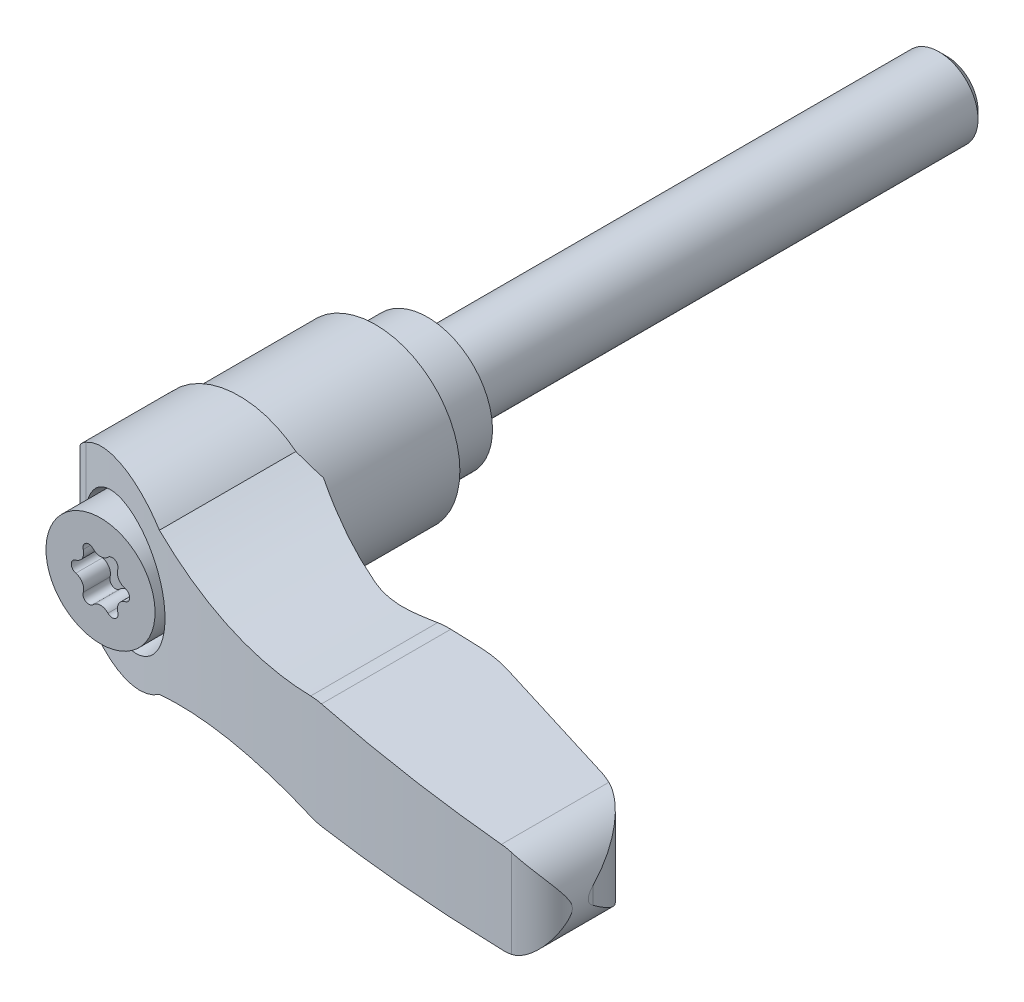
ISO-10303-21;
HEADER;
FILE_DESCRIPTION(('STEP AP214'),'2;1');
FILE_NAME('part.step','',(''),(''),'','','');
FILE_SCHEMA(('AUTOMOTIVE_DESIGN { 1 0 10303 214 1 1 1 1 }'));
ENDSEC;
DATA;
#1=APPLICATION_CONTEXT('core data for automotive mechanical design processes');
#2=APPLICATION_PROTOCOL_DEFINITION('international standard','automotive_design',2000,#1);
#3=PRODUCT_CONTEXT('',#1,'mechanical');
#4=PRODUCT('Part','Part','',(#3));
#5=PRODUCT_RELATED_PRODUCT_CATEGORY('part','',(#4));
#6=PRODUCT_DEFINITION_FORMATION('','',#4);
#7=PRODUCT_DEFINITION_CONTEXT('part definition',#1,'design');
#8=PRODUCT_DEFINITION('design','',#6,#7);
#9=PRODUCT_DEFINITION_SHAPE('','',#8);
#10=(LENGTH_UNIT() NAMED_UNIT(*) SI_UNIT(.MILLI.,.METRE.));
#11=(NAMED_UNIT(*) PLANE_ANGLE_UNIT() SI_UNIT($,.RADIAN.));
#12=(NAMED_UNIT(*) SI_UNIT($,.STERADIAN.) SOLID_ANGLE_UNIT());
#13=UNCERTAINTY_MEASURE_WITH_UNIT(LENGTH_MEASURE(1.E-05),#10,'distance_accuracy_value','');
#14=(GEOMETRIC_REPRESENTATION_CONTEXT(3) GLOBAL_UNCERTAINTY_ASSIGNED_CONTEXT((#13)) GLOBAL_UNIT_ASSIGNED_CONTEXT((#10,
#11,#12)) REPRESENTATION_CONTEXT('',''));
#15=CARTESIAN_POINT('',(0.,0.,0.));
#16=DIRECTION('',(0.,0.,1.));
#17=DIRECTION('',(1.,0.,0.));
#18=AXIS2_PLACEMENT_3D('',#15,#16,#17);
#19=CARTESIAN_POINT('',(39.938965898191,-8.,27.204249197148));
#20=DIRECTION('',(-0.989626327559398,0.,0.143665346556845));
#21=DIRECTION('',(-0.143665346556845,0.,-0.989626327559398));
#22=AXIS2_PLACEMENT_3D('',#19,#20,#21);
#23=PLANE('',#22);
#24=CARTESIAN_POINT('',(36.5,0.,3.51522972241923));
#25=DIRECTION('',(-0.989626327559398,0.,0.143665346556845));
#26=DIRECTION('',(0.143665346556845,0.,0.989626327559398));
#27=AXIS2_PLACEMENT_3D('',#24,#25,#26);
#28=ELLIPSE('',#27,24.3621728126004,3.5);
#29=CARTESIAN_POINT('',(39.938965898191,-0.650779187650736,27.204249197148));
#30=VERTEX_POINT('',#29);
#31=CARTESIAN_POINT('',(39.938965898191,0.650779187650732,27.204249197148));
#32=VERTEX_POINT('',#31);
#33=EDGE_CURVE('E438',#30,#32,#28,.T.);
#34=ORIENTED_EDGE('',*,*,#33,.F.);
#35=DIRECTION('',(0.,1.,0.));
#36=VECTOR('',#35,1.);
#37=CARTESIAN_POINT('',(39.938965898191,-8.,27.204249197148));
#38=LINE('',#37,#36);
#39=EDGE_CURVE('E283',#30,#32,#38,.T.);
#40=ORIENTED_EDGE('',*,*,#39,.T.);
#41=EDGE_LOOP('',(#34,#40));
#42=FACE_BOUND('',#41,.T.);
#43=ADVANCED_FACE('F14',(#42),#23,.F.);
#44=CARTESIAN_POINT('',(33.8626602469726,-8.,28.0863544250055));
#45=DIRECTION('',(0.,1.,0.));
#46=DIRECTION('',(-1.,0.,0.));
#47=AXIS2_PLACEMENT_3D('',#44,#45,#46);
#48=CYLINDRICAL_SURFACE('',#47,6.14000000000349);
#49=CARTESIAN_POINT('',(33.8626602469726,3.59762871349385,28.0863544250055));
#50=DIRECTION('',(0.0369925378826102,0.999315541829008,0.));
#51=DIRECTION('',(-0.999315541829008,0.0369925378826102,0.));
#52=AXIS2_PLACEMENT_3D('',#49,#50,#51);
#53=ELLIPSE('',#52,6.14420545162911,6.14000000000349);
#54=CARTESIAN_POINT('',(36.5,3.5,22.5416236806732));
#55=VERTEX_POINT('',#54);
#56=CARTESIAN_POINT('',(35.534460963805,3.53574220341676,22.178335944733));
#57=VERTEX_POINT('',#56);
#58=EDGE_CURVE('E606',#55,#57,#53,.T.);
#59=ORIENTED_EDGE('',*,*,#58,.F.);
#60=CARTESIAN_POINT('',(39.938965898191,0.650779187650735,27.204249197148));
#61=CARTESIAN_POINT('',(39.9247028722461,0.726086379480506,27.1059853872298));
#62=CARTESIAN_POINT('',(39.9079968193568,0.800887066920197,27.007686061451));
#63=CARTESIAN_POINT('',(39.8696347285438,0.949458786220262,26.8112602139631));
#64=CARTESIAN_POINT('',(39.8479781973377,1.02322971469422,26.7131337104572));
#65=CARTESIAN_POINT('',(39.7995979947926,1.16988012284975,26.5170899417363));
#66=CARTESIAN_POINT('',(39.7728626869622,1.24275713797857,26.4191736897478));
#67=CARTESIAN_POINT('',(39.7142815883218,1.38725410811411,26.2239599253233));
#68=CARTESIAN_POINT('',(39.6824358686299,1.45887408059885,26.1266624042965));
#69=CARTESIAN_POINT('',(39.5782917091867,1.67318502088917,25.8337016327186));
#70=CARTESIAN_POINT('',(39.4979263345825,1.81366367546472,25.6391889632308));
#71=CARTESIAN_POINT('',(39.3150854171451,2.08619457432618,25.2551202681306));
#72=CARTESIAN_POINT('',(39.2126344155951,2.21825596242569,25.0655590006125));
#73=CARTESIAN_POINT('',(38.9595027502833,2.49877334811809,24.6523338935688));
#74=CARTESIAN_POINT('',(38.8031801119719,2.64456339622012,24.4302018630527));
#75=CARTESIAN_POINT('',(38.5417124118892,2.84488994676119,24.108275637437));
#76=CARTESIAN_POINT('',(38.4501831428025,2.90854134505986,24.0029632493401));
#77=CARTESIAN_POINT('',(38.2579442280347,3.02861213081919,23.7967186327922));
#78=CARTESIAN_POINT('',(38.1572360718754,3.08503268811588,23.6957856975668));
#79=CARTESIAN_POINT('',(37.8892625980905,3.21757634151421,23.4457323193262));
#80=CARTESIAN_POINT('',(37.7155213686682,3.28779061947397,23.3001643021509));
#81=CARTESIAN_POINT('',(37.4396992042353,3.37286339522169,23.0946053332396));
#82=CARTESIAN_POINT('',(37.3453175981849,3.39783246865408,23.0282732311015));
#83=CARTESIAN_POINT('',(37.1517842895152,3.44019984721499,22.9003457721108));
#84=CARTESIAN_POINT('',(37.0526354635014,3.45760265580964,22.8387476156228));
#85=CARTESIAN_POINT('',(36.8781783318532,3.48029211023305,22.7372021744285));
#86=CARTESIAN_POINT('',(36.8038676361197,3.48759914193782,22.6959814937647));
#87=CARTESIAN_POINT('',(36.6533047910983,3.49745586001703,22.6165121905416));
#88=CARTESIAN_POINT('',(36.5770513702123,3.50000234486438,22.57826558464));
#89=CARTESIAN_POINT('',(36.5,3.5,22.5416236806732));
#90=B_SPLINE_CURVE_WITH_KNOTS('',3,(#60,#61,#62,#63,#64,#65,#66,#67,#68,#69,#70,#71,#72,#73,#74,
#75,#76,#77,#78,#79,#80,#81,#82,#83,#84,#85,#86,#87,#88,#89),.UNSPECIFIED.,.F.,.F.,(4,2,2,2,2,2,
2,2,2,2,2,2,2,2,4),(0.,0.373839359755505,0.747715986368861,1.1224598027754,1.49719840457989,
2.25512351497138,3.01221072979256,3.93367725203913,4.39332639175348,4.85290107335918,
5.56171222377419,5.91546495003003,6.26900683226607,6.52468766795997,6.78054039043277),.UNSPECIFIED.);
#91=EDGE_CURVE('E437',#32,#55,#90,.T.);
#92=ORIENTED_EDGE('',*,*,#91,.F.);
#93=ORIENTED_EDGE('',*,*,#39,.F.);
#94=CARTESIAN_POINT('',(36.5,-3.5,22.5416236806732));
#95=CARTESIAN_POINT('',(36.6061539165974,-3.50000941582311,22.5920863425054));
#96=CARTESIAN_POINT('',(36.7107657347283,-3.49517280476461,22.6456099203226));
#97=CARTESIAN_POINT('',(36.9160027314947,-3.47671082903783,22.7581011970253));
#98=CARTESIAN_POINT('',(37.016634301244,-3.46310021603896,22.8170596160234));
#99=CARTESIAN_POINT('',(37.212347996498,-3.42816986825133,22.9392782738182));
#100=CARTESIAN_POINT('',(37.3074768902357,-3.40693163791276,23.0024874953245));
#101=CARTESIAN_POINT('',(37.4929223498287,-3.35757592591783,23.1332068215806));
#102=CARTESIAN_POINT('',(37.5832363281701,-3.32945478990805,23.2007191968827));
#103=CARTESIAN_POINT('',(37.7830795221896,-3.2585052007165,23.3587409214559));
#104=CARTESIAN_POINT('',(37.8909927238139,-3.21376078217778,23.4504360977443));
#105=CARTESIAN_POINT('',(38.0982482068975,-3.11588681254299,23.6389903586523));
#106=CARTESIAN_POINT('',(38.1975840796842,-3.06275107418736,23.7358532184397));
#107=CARTESIAN_POINT('',(38.3880468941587,-2.94917464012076,23.934309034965));
#108=CARTESIAN_POINT('',(38.4791322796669,-2.88870020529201,24.035922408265));
#109=CARTESIAN_POINT('',(38.6526412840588,-2.761826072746,24.2426721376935));
#110=CARTESIAN_POINT('',(38.7350674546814,-2.69542813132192,24.3478074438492));
#111=CARTESIAN_POINT('',(38.9229341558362,-2.52996933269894,24.6038856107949));
#112=CARTESIAN_POINT('',(39.0243159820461,-2.42850340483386,24.7562617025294));
#113=CARTESIAN_POINT('',(39.2111706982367,-2.21796613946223,25.0654781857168));
#114=CARTESIAN_POINT('',(39.2966363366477,-2.10889136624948,25.2223205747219));
#115=CARTESIAN_POINT('',(39.4522229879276,-1.88493092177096,25.5392893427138));
#116=CARTESIAN_POINT('',(39.5223498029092,-1.77004746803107,25.6994144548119));
#117=CARTESIAN_POINT('',(39.6478320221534,-1.53583460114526,26.0220530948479));
#118=CARTESIAN_POINT('',(39.7031929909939,-1.41650688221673,26.1845656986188));
#119=CARTESIAN_POINT('',(39.7933776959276,-1.19018579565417,26.4900634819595));
#120=CARTESIAN_POINT('',(39.8299343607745,-1.08360162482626,26.6328455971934));
#121=CARTESIAN_POINT('',(39.8923391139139,-0.86858691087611,26.9185049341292));
#122=CARTESIAN_POINT('',(39.9182264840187,-0.760164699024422,27.0613798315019));
#123=CARTESIAN_POINT('',(39.938965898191,-0.650779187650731,27.204249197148));
#124=B_SPLINE_CURVE_WITH_KNOTS('',3,(#94,#95,#96,#97,#98,#99,#100,#101,#102,#103,#104,#105,#106,
#107,#108,#109,#110,#111,#112,#113,#114,#115,#116,#117,#118,#119,#120,#121,#122,#123),
.UNSPECIFIED.,.F.,.F.,(4,2,2,2,2,2,2,2,2,2,2,2,2,2,4),(0.,0.352350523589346,0.704110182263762,
1.05221781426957,1.40051067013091,1.84538152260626,2.29058194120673,2.73791274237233,
3.18511134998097,3.81198117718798,4.43913591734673,5.06605301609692,5.69273352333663,
6.23807905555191,6.78139842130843),.UNSPECIFIED.);
#125=CARTESIAN_POINT('',(36.5,-3.5,22.5416236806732));
#126=VERTEX_POINT('',#125);
#127=EDGE_CURVE('E431',#126,#30,#124,.T.);
#128=ORIENTED_EDGE('',*,*,#127,.F.);
#129=CARTESIAN_POINT('',(33.8626602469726,-3.59762871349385,28.0863544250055));
#130=DIRECTION('',(0.0369925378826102,-0.999315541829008,0.));
#131=DIRECTION('',(0.999315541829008,0.0369925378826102,0.));
#132=AXIS2_PLACEMENT_3D('',#129,#130,#131);
#133=ELLIPSE('',#132,6.14420545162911,6.14000000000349);
#134=CARTESIAN_POINT('',(35.534460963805,-3.53574220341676,22.178335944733));
#135=VERTEX_POINT('',#134);
#136=EDGE_CURVE('E591',#135,#126,#133,.T.);
#137=ORIENTED_EDGE('',*,*,#136,.F.);
#138=DIRECTION('',(0.,1.,0.));
#139=VECTOR('',#138,1.);
#140=CARTESIAN_POINT('',(35.534460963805,-8.,22.178335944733));
#141=LINE('',#140,#139);
#142=EDGE_CURVE('E286',#135,#57,#141,.T.);
#143=ORIENTED_EDGE('',*,*,#142,.T.);
#144=EDGE_LOOP('',(#59,#92,#93,#128,#137,#143));
#145=FACE_BOUND('',#144,.T.);
#146=ADVANCED_FACE('F444',(#145),#48,.T.);
#147=CARTESIAN_POINT('',(25.51080482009,-8.,19.34192715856));
#148=DIRECTION('',(-0.272280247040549,0.,0.962217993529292));
#149=DIRECTION('',(-0.962217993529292,0.,-0.272280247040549));
#150=AXIS2_PLACEMENT_3D('',#147,#148,#149);
#151=PLANE('',#150);
#152=DIRECTION('',(-0.961608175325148,0.0355966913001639,-0.272107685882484));
#153=VECTOR('',#152,1.);
#154=CARTESIAN_POINT('',(25.918375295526,3.8917092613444,19.457257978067));
#155=LINE('',#154,#153);
#156=CARTESIAN_POINT('',(25.51080482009,3.90679665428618,19.34192715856));
#157=VERTEX_POINT('',#156);
#158=EDGE_CURVE('E1530',#57,#157,#155,.T.);
#159=ORIENTED_EDGE('',*,*,#158,.F.);
#160=ORIENTED_EDGE('',*,*,#142,.F.);
#161=DIRECTION('',(0.961608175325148,0.0355966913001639,0.272107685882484));
#162=VECTOR('',#161,1.);
#163=CARTESIAN_POINT('',(25.3706941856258,-3.9119832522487,19.3022798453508));
#164=LINE('',#163,#162);
#165=CARTESIAN_POINT('',(25.51080482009,-3.90679665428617,19.34192715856));
#166=VERTEX_POINT('',#165);
#167=EDGE_CURVE('E593',#166,#135,#164,.T.);
#168=ORIENTED_EDGE('',*,*,#167,.F.);
#169=DIRECTION('',(0.,1.,0.));
#170=VECTOR('',#169,1.);
#171=CARTESIAN_POINT('',(25.51080482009,-8.,19.34192715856));
#172=LINE('',#171,#170);
#173=EDGE_CURVE('E289',#166,#157,#172,.T.);
#174=ORIENTED_EDGE('',*,*,#173,.T.);
#175=EDGE_LOOP('',(#159,#160,#168,#174));
#176=FACE_BOUND('',#175,.T.);
#177=ADVANCED_FACE('F448',(#176),#151,.F.);
#178=CARTESIAN_POINT('',(23.0466685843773,-8.,28.0499999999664));
#179=DIRECTION('',(0.,1.,0.));
#180=DIRECTION('',(-1.,0.,0.));
#181=AXIS2_PLACEMENT_3D('',#178,#179,#180);
#182=CYLINDRICAL_SURFACE('',#181,9.04999999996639);
#183=CARTESIAN_POINT('',(23.0466685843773,3.99801374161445,28.0499999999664));
#184=DIRECTION('',(0.0369925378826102,0.999315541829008,0.));
#185=DIRECTION('',(-0.999315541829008,0.0369925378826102,0.));
#186=AXIS2_PLACEMENT_3D('',#183,#184,#185);
#187=ELLIPSE('',#186,9.05619858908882,9.04999999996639);
#188=CARTESIAN_POINT('',(23.046668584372,3.99801374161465,19.));
#189=VERTEX_POINT('',#188);
#190=EDGE_CURVE('E1525',#157,#189,#187,.T.);
#191=ORIENTED_EDGE('',*,*,#190,.F.);
#192=ORIENTED_EDGE('',*,*,#173,.F.);
#193=CARTESIAN_POINT('',(23.0466685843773,-3.99801374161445,28.0499999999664));
#194=DIRECTION('',(0.0369925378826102,-0.999315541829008,0.));
#195=DIRECTION('',(0.999315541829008,0.0369925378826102,0.));
#196=AXIS2_PLACEMENT_3D('',#193,#194,#195);
#197=ELLIPSE('',#196,9.05619858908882,9.04999999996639);
#198=CARTESIAN_POINT('',(23.046668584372,-3.99801374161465,19.));
#199=VERTEX_POINT('',#198);
#200=EDGE_CURVE('E595',#199,#166,#197,.T.);
#201=ORIENTED_EDGE('',*,*,#200,.F.);
#202=DIRECTION('',(0.,1.,0.));
#203=VECTOR('',#202,1.);
#204=CARTESIAN_POINT('',(23.046668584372,-8.,19.));
#205=LINE('',#204,#203);
#206=EDGE_CURVE('E292',#199,#189,#205,.T.);
#207=ORIENTED_EDGE('',*,*,#206,.T.);
#208=EDGE_LOOP('',(#191,#192,#201,#207));
#209=FACE_BOUND('',#208,.T.);
#210=ADVANCED_FACE('F453',(#209),#182,.T.);
#211=CARTESIAN_POINT('',(17.750423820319,-8.,19.));
#212=DIRECTION('',(0.,0.,1.));
#213=DIRECTION('',(0.,-1.,0.));
#214=AXIS2_PLACEMENT_3D('',#211,#212,#213);
#215=PLANE('',#214);
#216=CARTESIAN_POINT('',(14.8,33.6,19.));
#217=DIRECTION('',(0.,0.,1.));
#218=DIRECTION('',(0.,-1.,0.));
#219=AXIS2_PLACEMENT_3D('',#216,#217,#218);
#220=CIRCLE('',#219,30.);
#221=CARTESIAN_POINT('',(19.776621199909,4.0156588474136,19.));
#222=VERTEX_POINT('',#221);
#223=CARTESIAN_POINT('',(17.750423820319,3.74543587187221,19.));
#224=VERTEX_POINT('',#223);
#225=EDGE_CURVE('E488',#222,#224,#220,.F.);
#226=ORIENTED_EDGE('',*,*,#225,.F.);
#227=CARTESIAN_POINT('',(20.6060580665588,-0.915064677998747,19.));
#228=DIRECTION('',(0.,0.,1.));
#229=DIRECTION('',(0.,-1.,0.));
#230=AXIS2_PLACEMENT_3D('',#227,#228,#229);
#231=CIRCLE('',#230,4.99999999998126);
#232=CARTESIAN_POINT('',(20.791020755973,4.0815130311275,19.));
#233=VERTEX_POINT('',#232);
#234=EDGE_CURVE('E1534',#233,#222,#231,.T.);
#235=ORIENTED_EDGE('',*,*,#234,.F.);
#236=DIRECTION('',(-0.999315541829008,0.0369925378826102,0.));
#237=VECTOR('',#236,1.);
#238=CARTESIAN_POINT('',(18.2012046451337,4.17738252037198,19.));
#239=LINE('',#238,#237);
#240=EDGE_CURVE('E559',#189,#233,#239,.T.);
#241=ORIENTED_EDGE('',*,*,#240,.F.);
#242=ORIENTED_EDGE('',*,*,#206,.F.);
#243=DIRECTION('',(0.999315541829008,0.0369925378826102,0.));
#244=VECTOR('',#243,1.);
#245=CARTESIAN_POINT('',(17.6097291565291,-4.19927768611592,19.));
#246=LINE('',#245,#244);
#247=CARTESIAN_POINT('',(20.791020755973,-4.0815130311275,19.));
#248=VERTEX_POINT('',#247);
#249=EDGE_CURVE('E596',#248,#199,#246,.T.);
#250=ORIENTED_EDGE('',*,*,#249,.F.);
#251=CARTESIAN_POINT('',(20.6060580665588,0.915064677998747,19.));
#252=DIRECTION('',(0.,0.,1.));
#253=DIRECTION('',(0.,-1.,0.));
#254=AXIS2_PLACEMENT_3D('',#251,#252,#253);
#255=CIRCLE('',#254,4.99999999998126);
#256=CARTESIAN_POINT('',(19.776621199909,-4.01565884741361,19.));
#257=VERTEX_POINT('',#256);
#258=EDGE_CURVE('E583',#257,#248,#255,.T.);
#259=ORIENTED_EDGE('',*,*,#258,.F.);
#260=CARTESIAN_POINT('',(14.8,-33.6,19.));
#261=DIRECTION('',(0.,0.,1.));
#262=DIRECTION('',(0.,-1.,0.));
#263=AXIS2_PLACEMENT_3D('',#260,#261,#262);
#264=CIRCLE('',#263,30.);
#265=CARTESIAN_POINT('',(17.750423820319,-3.74543587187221,19.));
#266=VERTEX_POINT('',#265);
#267=EDGE_CURVE('E578',#266,#257,#264,.F.);
#268=ORIENTED_EDGE('',*,*,#267,.F.);
#269=DIRECTION('',(0.,1.,0.));
#270=VECTOR('',#269,1.);
#271=CARTESIAN_POINT('',(17.750423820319,-8.,19.));
#272=LINE('',#271,#270);
#273=EDGE_CURVE('E295',#266,#224,#272,.T.);
#274=ORIENTED_EDGE('',*,*,#273,.T.);
#275=EDGE_LOOP('',(#226,#235,#241,#242,#250,#259,#268,#274));
#276=FACE_BOUND('',#275,.T.);
#277=ADVANCED_FACE('F457',(#276),#215,.F.);
#278=CARTESIAN_POINT('',(17.7504238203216,-8.,9.94999999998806));
#279=DIRECTION('',(0.,1.,0.));
#280=DIRECTION('',(-1.,0.,0.));
#281=AXIS2_PLACEMENT_3D('',#278,#279,#280);
#282=CYLINDRICAL_SURFACE('',#281,9.05000000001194);
#283=CARTESIAN_POINT('',(17.750423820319,3.74543587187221,19.));
#284=CARTESIAN_POINT('',(17.5046390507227,3.72111558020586,19.0000347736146));
#285=CARTESIAN_POINT('',(17.2585407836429,3.69988852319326,18.9899888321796));
#286=CARTESIAN_POINT('',(16.7673975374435,3.66357523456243,18.9498183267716));
#287=CARTESIAN_POINT('',(16.5223532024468,3.6484923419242,18.9196828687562));
#288=CARTESIAN_POINT('',(16.0394135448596,3.62465265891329,18.8400993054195));
#289=CARTESIAN_POINT('',(15.8014675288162,3.61579257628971,18.7909886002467));
#290=CARTESIAN_POINT('',(15.3302904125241,3.60376296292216,18.673778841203));
#291=CARTESIAN_POINT('',(15.0970562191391,3.60058957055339,18.6056927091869));
#292=CARTESIAN_POINT('',(14.7640124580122,3.59984438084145,18.4937500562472));
#293=CARTESIAN_POINT('',(14.6616681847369,3.60014663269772,18.4572847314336));
#294=CARTESIAN_POINT('',(14.4579719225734,3.60177627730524,18.3805483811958));
#295=CARTESIAN_POINT('',(14.3566253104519,3.60310763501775,18.340263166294));
#296=CARTESIAN_POINT('',(14.2560355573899,3.60493202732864,18.2981585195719));
#297=B_SPLINE_CURVE_WITH_KNOTS('',3,(#283,#284,#285,#286,#287,#288,#289,#290,#291,#292,#293,
#294,#295,#296),.UNSPECIFIED.,.F.,.F.,(4,2,2,2,2,2,4),(0.,0.7407456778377,1.48189337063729,
2.21042785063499,2.93846742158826,3.26434594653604,3.59148632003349),.UNSPECIFIED.);
#298=CARTESIAN_POINT('',(14.2560355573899,3.60493202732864,18.2981585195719));
#299=VERTEX_POINT('',#298);
#300=EDGE_CURVE('E480',#224,#299,#297,.T.);
#301=ORIENTED_EDGE('',*,*,#300,.F.);
#302=ORIENTED_EDGE('',*,*,#273,.F.);
#303=CARTESIAN_POINT('',(14.2560355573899,-3.60493202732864,18.2981585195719));
#304=CARTESIAN_POINT('',(14.483816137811,-3.60077563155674,18.3935396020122));
#305=CARTESIAN_POINT('',(14.7155749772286,-3.59919241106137,18.4795580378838));
#306=CARTESIAN_POINT('',(15.1854578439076,-3.60156277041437,18.6324166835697));
#307=CARTESIAN_POINT('',(15.423585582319,-3.60551965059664,18.6992454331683));
#308=CARTESIAN_POINT('',(15.9002362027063,-3.61924836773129,18.8121846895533));
#309=CARTESIAN_POINT('',(16.1386829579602,-3.62891979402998,18.8586293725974));
#310=CARTESIAN_POINT('',(16.6180975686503,-3.65418161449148,18.9321530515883));
#311=CARTESIAN_POINT('',(16.85906355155,-3.6697678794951,18.9592455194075));
#312=CARTESIAN_POINT('',(17.2084780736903,-3.69663888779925,18.9844088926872));
#313=CARTESIAN_POINT('',(17.316603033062,-3.70554405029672,18.9902441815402));
#314=CARTESIAN_POINT('',(17.5333084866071,-3.72457700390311,18.9980471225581));
#315=CARTESIAN_POINT('',(17.6418891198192,-3.73470940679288,18.9999996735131));
#316=CARTESIAN_POINT('',(17.750423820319,-3.74543587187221,19.));
#317=B_SPLINE_CURVE_WITH_KNOTS('',3,(#303,#304,#305,#306,#307,#308,#309,#310,#311,#312,#313,
#314,#315,#316),.UNSPECIFIED.,.F.,.F.,(4,2,2,2,2,2,4),(0.,0.740736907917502,1.48191527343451,
2.21044217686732,2.93846142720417,3.26434207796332,3.59148772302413),.UNSPECIFIED.);
#318=CARTESIAN_POINT('',(14.2560355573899,-3.60493202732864,18.2981585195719));
#319=VERTEX_POINT('',#318);
#320=EDGE_CURVE('E472',#319,#266,#317,.T.);
#321=ORIENTED_EDGE('',*,*,#320,.F.);
#322=DIRECTION('',(0.,1.,0.));
#323=VECTOR('',#322,1.);
#324=CARTESIAN_POINT('',(14.2560355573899,-8.,18.2981585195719));
#325=LINE('',#324,#323);
#326=EDGE_CURVE('E298',#319,#299,#325,.T.);
#327=ORIENTED_EDGE('',*,*,#326,.T.);
#328=EDGE_LOOP('',(#301,#302,#321,#327));
#329=FACE_BOUND('',#328,.T.);
#330=ADVANCED_FACE('F461',(#329),#282,.F.);
#331=CARTESIAN_POINT('',(42.8289340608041,-8.,-49.9630271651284));
#332=DIRECTION('',(0.,1.,0.));
#333=DIRECTION('',(-1.,0.,0.));
#334=AXIS2_PLACEMENT_3D('',#331,#332,#333);
#335=CYLINDRICAL_SURFACE('',#334,73.9999999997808);
#336=ORIENTED_EDGE('',*,*,#326,.F.);
#337=CARTESIAN_POINT('',(6.49,-4.77390244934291,14.5));
#338=CARTESIAN_POINT('',(7.10709183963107,-4.59600017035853,14.8479114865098));
#339=CARTESIAN_POINT('',(7.73340291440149,-4.43691869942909,15.1892512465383));
#340=CARTESIAN_POINT('',(8.9999083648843,-4.15891482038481,15.8557045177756));
#341=CARTESIAN_POINT('',(9.64003521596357,-4.03983028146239,16.1808788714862));
#342=CARTESIAN_POINT('',(10.9347595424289,-3.84283944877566,16.814824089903));
#343=CARTESIAN_POINT('',(11.5893580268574,-3.76493603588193,17.1235938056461));
#344=CARTESIAN_POINT('',(12.5814258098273,-3.68029491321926,17.5737847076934));
#345=CARTESIAN_POINT('',(12.9145226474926,-3.65743626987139,17.7219861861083));
#346=CARTESIAN_POINT('',(13.583370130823,-3.62280963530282,18.0136612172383));
#347=CARTESIAN_POINT('',(13.9191209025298,-3.6110421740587,18.1571345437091));
#348=CARTESIAN_POINT('',(14.2560355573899,-3.60493202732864,18.298158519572));
#349=B_SPLINE_CURVE_WITH_KNOTS('',3,(#337,#338,#339,#340,#341,#342,#343,#344,#345,#346,#347,
#348),.UNSPECIFIED.,.F.,.F.,(4,2,2,2,2,4),(0.,2.19098662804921,4.37298159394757,
6.55512918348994,7.6508296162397,8.74658240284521),.UNSPECIFIED.);
#350=CARTESIAN_POINT('',(6.49,-4.77390244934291,14.5));
#351=VERTEX_POINT('',#350);
#352=EDGE_CURVE('E518',#351,#319,#349,.T.);
#353=ORIENTED_EDGE('',*,*,#352,.F.);
#354=DIRECTION('',(0.,1.,0.));
#355=VECTOR('',#354,1.);
#356=CARTESIAN_POINT('',(6.49,-8.,14.5));
#357=LINE('',#356,#355);
#358=CARTESIAN_POINT('',(6.49,0.,14.5));
#359=VERTEX_POINT('',#358);
#360=EDGE_CURVE('E302',#351,#359,#357,.T.);
#361=ORIENTED_EDGE('',*,*,#360,.T.);
#362=CARTESIAN_POINT('',(6.49,4.77390244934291,14.5));
#363=VERTEX_POINT('',#362);
#364=EDGE_CURVE('E301',#359,#363,#357,.T.);
#365=ORIENTED_EDGE('',*,*,#364,.T.);
#366=CARTESIAN_POINT('',(14.2560355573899,3.60493202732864,18.2981585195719));
#367=CARTESIAN_POINT('',(13.9191209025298,3.6110421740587,18.157134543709));
#368=CARTESIAN_POINT('',(13.583370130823,3.62280963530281,18.0136612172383));
#369=CARTESIAN_POINT('',(12.9145226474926,3.65743626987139,17.7219861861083));
#370=CARTESIAN_POINT('',(12.5814258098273,3.68029491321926,17.5737847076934));
#371=CARTESIAN_POINT('',(11.5893580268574,3.76493603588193,17.1235938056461));
#372=CARTESIAN_POINT('',(10.9347595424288,3.84283944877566,16.814824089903));
#373=CARTESIAN_POINT('',(9.64003521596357,4.03983028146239,16.1808788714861));
#374=CARTESIAN_POINT('',(8.9999083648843,4.15891482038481,15.8557045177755));
#375=CARTESIAN_POINT('',(7.73340291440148,4.43691869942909,15.1892512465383));
#376=CARTESIAN_POINT('',(7.10709183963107,4.59600017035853,14.8479114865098));
#377=CARTESIAN_POINT('',(6.49,4.77390244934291,14.5));
#378=B_SPLINE_CURVE_WITH_KNOTS('',3,(#366,#367,#368,#369,#370,#371,#372,#373,#374,#375,#376,
#377),.UNSPECIFIED.,.F.,.F.,(4,2,2,2,2,4),(0.,1.0957527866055,2.19145321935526,4.37360080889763,
6.55559577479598,8.74658240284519),.UNSPECIFIED.);
#379=EDGE_CURVE('E487',#299,#363,#378,.T.);
#380=ORIENTED_EDGE('',*,*,#379,.F.);
#381=EDGE_LOOP('',(#336,#353,#361,#365,#380));
#382=FACE_BOUND('',#381,.T.);
#383=ADVANCED_FACE('F466',(#382),#335,.F.);
#384=CARTESIAN_POINT('',(14.8,33.6,0.));
#385=DIRECTION('',(0.,0.,1.));
#386=DIRECTION('',(0.,-1.,0.));
#387=AXIS2_PLACEMENT_3D('',#384,#385,#386);
#388=CYLINDRICAL_SURFACE('',#387,30.);
#389=CARTESIAN_POINT('',(14.8,33.6,14.5));
#390=DIRECTION('',(0.,0.,1.));
#391=DIRECTION('',(0.,-1.,0.));
#392=AXIS2_PLACEMENT_3D('',#389,#390,#391);
#393=CIRCLE('',#392,30.);
#394=CARTESIAN_POINT('',(4.3627858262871,5.4741300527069,14.5));
#395=VERTEX_POINT('',#394);
#396=EDGE_CURVE('E495',#363,#395,#393,.F.);
#397=ORIENTED_EDGE('',*,*,#396,.T.);
#398=DIRECTION('',(0.,0.,1.));
#399=VECTOR('',#398,1.);
#400=CARTESIAN_POINT('',(4.3627858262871,5.4741300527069,0.));
#401=LINE('',#400,#399);
#402=CARTESIAN_POINT('',(4.3627858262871,5.4741300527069,25.0085693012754));
#403=VERTEX_POINT('',#402);
#404=EDGE_CURVE('E528',#395,#403,#401,.T.);
#405=ORIENTED_EDGE('',*,*,#404,.T.);
#406=CARTESIAN_POINT('',(4.36278582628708,5.47413005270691,25.0085693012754));
#407=CARTESIAN_POINT('',(4.76153276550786,5.32616217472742,25.1305821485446));
#408=CARTESIAN_POINT('',(5.16363009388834,5.1865941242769,25.2516463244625));
#409=CARTESIAN_POINT('',(5.97401057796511,4.92451651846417,25.4915739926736));
#410=CARTESIAN_POINT('',(6.38229396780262,4.80200761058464,25.6104374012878));
#411=CARTESIAN_POINT('',(7.6158745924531,4.46039912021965,25.9633347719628));
#412=CARTESIAN_POINT('',(8.44964003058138,4.2673151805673,26.1935954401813));
#413=CARTESIAN_POINT('',(10.1156680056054,3.95611406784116,26.636662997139));
#414=CARTESIAN_POINT('',(10.9475779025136,3.83647524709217,26.84973860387));
#415=CARTESIAN_POINT('',(12.6216846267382,3.66737574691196,27.2617982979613));
#416=CARTESIAN_POINT('',(13.4638761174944,3.61788010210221,27.460789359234));
#417=CARTESIAN_POINT('',(14.7611760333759,3.5966016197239,27.7544685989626));
#418=CARTESIAN_POINT('',(15.2147501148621,3.59943074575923,27.8547479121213));
#419=CARTESIAN_POINT('',(16.1222596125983,3.62571788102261,28.0506078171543));
#420=CARTESIAN_POINT('',(16.5761949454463,3.64917203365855,28.1461892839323));
#421=CARTESIAN_POINT('',(17.4888250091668,3.71719507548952,28.3335810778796));
#422=CARTESIAN_POINT('',(17.9475132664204,3.76200786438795,28.425334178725));
#423=CARTESIAN_POINT('',(18.8634404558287,3.87288367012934,28.6037588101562));
#424=CARTESIAN_POINT('',(19.3206789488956,3.93895260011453,28.6904289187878));
#425=CARTESIAN_POINT('',(19.776621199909,4.01565884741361,28.7744790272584));
#426=B_SPLINE_CURVE_WITH_KNOTS('',3,(#406,#407,#408,#409,#410,#411,#412,#413,#414,#415,#416,
#417,#418,#419,#420,#421,#422,#423,#424,#425),.UNSPECIFIED.,.F.,.F.,(4,2,2,2,2,2,2,2,2,4),(0.,
1.32721529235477,2.65448094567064,5.30988283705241,7.90822882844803,10.5052791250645,
11.8984814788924,13.2914233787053,14.7006672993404,16.1103035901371),.UNSPECIFIED.);
#427=CARTESIAN_POINT('',(19.776621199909,4.0156588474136,28.7744790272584));
#428=VERTEX_POINT('',#427);
#429=EDGE_CURVE('E388',#403,#428,#426,.T.);
#430=ORIENTED_EDGE('',*,*,#429,.T.);
#431=DIRECTION('',(0.,0.,1.));
#432=VECTOR('',#431,1.);
#433=CARTESIAN_POINT('',(19.776621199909,4.0156588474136,0.));
#434=LINE('',#433,#432);
#435=EDGE_CURVE('E342',#222,#428,#434,.T.);
#436=ORIENTED_EDGE('',*,*,#435,.F.);
#437=ORIENTED_EDGE('',*,*,#225,.T.);
#438=ORIENTED_EDGE('',*,*,#300,.T.);
#439=ORIENTED_EDGE('',*,*,#379,.T.);
#440=EDGE_LOOP('',(#397,#405,#430,#436,#437,#438,#439));
#441=FACE_BOUND('',#440,.T.);
#442=ADVANCED_FACE('F327',(#441),#388,.F.);
#443=CARTESIAN_POINT('',(20.6060580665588,-0.915064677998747,0.));
#444=DIRECTION('',(0.,0.,1.));
#445=DIRECTION('',(0.,-1.,0.));
#446=AXIS2_PLACEMENT_3D('',#443,#444,#445);
#447=CYLINDRICAL_SURFACE('',#446,4.99999999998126);
#448=ORIENTED_EDGE('',*,*,#234,.T.);
#449=ORIENTED_EDGE('',*,*,#435,.T.);
#450=CARTESIAN_POINT('',(19.776621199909,4.0156588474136,28.7744790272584));
#451=CARTESIAN_POINT('',(19.944491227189,4.04386032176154,28.8054315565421));
#452=CARTESIAN_POINT('',(20.1129595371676,4.06344890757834,28.8361672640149));
#453=CARTESIAN_POINT('',(20.4510927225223,4.08540030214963,28.8972050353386));
#454=CARTESIAN_POINT('',(20.6207575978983,4.08776311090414,28.9275070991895));
#455=CARTESIAN_POINT('',(20.791020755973,4.0815130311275,28.9575923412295));
#456=B_SPLINE_CURVE_WITH_KNOTS('',3,(#450,#451,#452,#453,#454,#455),.UNSPECIFIED.,.F.,.F.,(4,2,
4),(0.,0.517097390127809,1.03419478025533),.UNSPECIFIED.);
#457=CARTESIAN_POINT('',(20.791020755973,4.0815130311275,28.9575923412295));
#458=VERTEX_POINT('',#457);
#459=EDGE_CURVE('E394',#428,#458,#456,.T.);
#460=ORIENTED_EDGE('',*,*,#459,.T.);
#461=DIRECTION('',(0.,0.,1.));
#462=VECTOR('',#461,1.);
#463=CARTESIAN_POINT('',(20.791020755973,4.0815130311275,0.));
#464=LINE('',#463,#462);
#465=EDGE_CURVE('E343',#233,#458,#464,.T.);
#466=ORIENTED_EDGE('',*,*,#465,.F.);
#467=EDGE_LOOP('',(#448,#449,#460,#466));
#468=FACE_BOUND('',#467,.T.);
#469=ADVANCED_FACE('F655',(#468),#447,.T.);
#470=CARTESIAN_POINT('',(36.5,3.5,0.));
#471=DIRECTION('',(0.0369925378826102,0.999315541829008,0.));
#472=DIRECTION('',(-0.999315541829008,0.0369925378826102,0.));
#473=AXIS2_PLACEMENT_3D('',#470,#471,#472);
#474=PLANE('',#473);
#475=ORIENTED_EDGE('',*,*,#240,.T.);
#476=ORIENTED_EDGE('',*,*,#465,.T.);
#477=CARTESIAN_POINT('',(44.8871950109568,3.18952386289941,-107.430179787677));
#478=DIRECTION('',(0.0369925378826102,0.999315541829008,0.));
#479=DIRECTION('',(-0.999315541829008,0.0369925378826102,0.));
#480=AXIS2_PLACEMENT_3D('',#477,#478,#479);
#481=ELLIPSE('',#480,138.594862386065,138.500000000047);
#482=CARTESIAN_POINT('',(36.5,3.5,30.8156337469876));
#483=VERTEX_POINT('',#482);
#484=EDGE_CURVE('E408',#458,#483,#481,.T.);
#485=ORIENTED_EDGE('',*,*,#484,.T.);
#486=DIRECTION('',(0.,0.,1.));
#487=VECTOR('',#486,1.);
#488=CARTESIAN_POINT('',(36.5,3.5,0.));
#489=LINE('',#488,#487);
#490=EDGE_CURVE('E547',#55,#483,#489,.T.);
#491=ORIENTED_EDGE('',*,*,#490,.F.);
#492=ORIENTED_EDGE('',*,*,#58,.T.);
#493=ORIENTED_EDGE('',*,*,#158,.T.);
#494=ORIENTED_EDGE('',*,*,#190,.T.);
#495=EDGE_LOOP('',(#475,#476,#485,#491,#492,#493,#494));
#496=FACE_BOUND('',#495,.T.);
#497=ADVANCED_FACE('F416',(#496),#474,.T.);
#498=CARTESIAN_POINT('',(37.4659985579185,-8.,28.2670414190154));
#499=DIRECTION('',(0.,1.,0.));
#500=DIRECTION('',(-1.,0.,0.));
#501=AXIS2_PLACEMENT_3D('',#498,#499,#500);
#502=CYLINDRICAL_SURFACE('',#501,2.60000000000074);
#503=CARTESIAN_POINT('',(37.324018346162,3.40161634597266,30.863161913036));
#504=CARTESIAN_POINT('',(37.3919714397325,3.38517327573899,30.8668921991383));
#505=CARTESIAN_POINT('',(37.4595366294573,3.36663320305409,30.8678982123));
#506=CARTESIAN_POINT('',(37.5932555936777,3.32560440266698,30.8647814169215));
#507=CARTESIAN_POINT('',(37.6594109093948,3.30312026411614,30.8606645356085));
#508=CARTESIAN_POINT('',(37.789242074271,3.25463078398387,30.8476880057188));
#509=CARTESIAN_POINT('',(37.8529349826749,3.2286592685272,30.8388717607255));
#510=CARTESIAN_POINT('',(37.9780608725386,3.17332967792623,30.8169101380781));
#511=CARTESIAN_POINT('',(38.0394932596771,3.14397072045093,30.8037636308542));
#512=CARTESIAN_POINT('',(38.2193405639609,3.0515477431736,30.7585650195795));
#513=CARTESIAN_POINT('',(38.3339861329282,2.98387991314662,30.7206782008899));
#514=CARTESIAN_POINT('',(38.5517467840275,2.83858348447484,30.632420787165));
#515=CARTESIAN_POINT('',(38.654834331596,2.76093200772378,30.5820212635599));
#516=CARTESIAN_POINT('',(38.8266237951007,2.61655584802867,30.4842690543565));
#517=CARTESIAN_POINT('',(38.897792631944,2.55140368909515,30.438863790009));
#518=CARTESIAN_POINT('',(39.0330318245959,2.41719472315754,30.3433991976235));
#519=CARTESIAN_POINT('',(39.0970985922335,2.34813596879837,30.2933375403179));
#520=CARTESIAN_POINT('',(39.2184581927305,2.2065161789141,30.1893556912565));
#521=CARTESIAN_POINT('',(39.2757265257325,2.13394372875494,30.135422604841));
#522=CARTESIAN_POINT('',(39.3834200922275,1.98601495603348,30.0247265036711));
#523=CARTESIAN_POINT('',(39.4338475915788,1.91065956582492,29.9679644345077));
#524=CARTESIAN_POINT('',(39.5424214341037,1.73419420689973,29.8348143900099));
#525=CARTESIAN_POINT('',(39.5982635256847,1.63221056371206,29.7576996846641));
#526=CARTESIAN_POINT('',(39.6992505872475,1.42414609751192,29.6016727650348));
#527=CARTESIAN_POINT('',(39.7443776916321,1.31805876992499,29.5227577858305));
#528=CARTESIAN_POINT('',(39.823974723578,1.10201279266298,29.3659397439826));
#529=CARTESIAN_POINT('',(39.8584944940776,0.99207503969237,29.2880336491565));
#530=CARTESIAN_POINT('',(39.9024720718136,0.822533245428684,29.17546551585));
#531=CARTESIAN_POINT('',(39.9158188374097,0.765322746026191,29.1387021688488));
#532=CARTESIAN_POINT('',(39.9398686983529,0.648731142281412,29.0678855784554));
#533=CARTESIAN_POINT('',(39.9505741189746,0.589352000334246,29.033829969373));
#534=CARTESIAN_POINT('',(39.9677206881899,0.47708631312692,28.975671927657));
#535=CARTESIAN_POINT('',(39.9745675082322,0.424644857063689,28.9508463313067));
#536=CARTESIAN_POINT('',(39.9860225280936,0.317100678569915,28.9073412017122));
#537=CARTESIAN_POINT('',(39.9906385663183,0.262008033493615,28.888640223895));
#538=CARTESIAN_POINT('',(39.9966232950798,0.160247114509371,28.8637621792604));
#539=CARTESIAN_POINT('',(39.9984523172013,0.114054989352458,28.8558445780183));
#540=CARTESIAN_POINT('',(40.0002450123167,0.0209847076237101,28.8480882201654));
#541=CARTESIAN_POINT('',(40.0002117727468,-0.0258921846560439,28.8482360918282));
#542=CARTESIAN_POINT('',(39.9982952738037,-0.118672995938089,28.8565205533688));
#543=CARTESIAN_POINT('',(39.9964185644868,-0.164579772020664,28.8646288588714));
#544=CARTESIAN_POINT('',(39.9910078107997,-0.254792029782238,28.8870889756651));
#545=CARTESIAN_POINT('',(39.9874686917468,-0.299092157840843,28.9014598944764));
#546=CARTESIAN_POINT('',(39.9768286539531,-0.407331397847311,28.9425912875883));
#547=CARTESIAN_POINT('',(39.9688318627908,-0.470155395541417,28.9719647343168));
#548=CARTESIAN_POINT('',(39.9499914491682,-0.592804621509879,29.0357410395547));
#549=CARTESIAN_POINT('',(39.9391403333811,-0.652621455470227,29.0701570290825));
#550=CARTESIAN_POINT('',(39.9146680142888,-0.770512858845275,29.1419527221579));
#551=CARTESIAN_POINT('',(39.9010255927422,-0.828569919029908,29.1793537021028));
#552=CARTESIAN_POINT('',(39.8711029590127,-0.942947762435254,29.2555520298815));
#553=CARTESIAN_POINT('',(39.8548256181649,-0.999270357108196,29.2943478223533));
#554=CARTESIAN_POINT('',(39.8016739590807,-1.16742991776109,29.4125134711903));
#555=CARTESIAN_POINT('',(39.760726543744,-1.27728939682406,29.4929030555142));
#556=CARTESIAN_POINT('',(39.6677865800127,-1.49294867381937,29.65295004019));
#557=CARTESIAN_POINT('',(39.6157834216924,-1.59874445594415,29.7326066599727));
#558=CARTESIAN_POINT('',(39.5005966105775,-1.80564912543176,29.8886982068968));
#559=CARTESIAN_POINT('',(39.4374685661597,-1.90677830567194,29.9651469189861));
#560=CARTESIAN_POINT('',(39.2994325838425,-2.10420227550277,30.1133265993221));
#561=CARTESIAN_POINT('',(39.2245348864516,-2.20050117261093,30.1850615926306));
#562=CARTESIAN_POINT('',(39.0442952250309,-2.40820732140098,30.3372677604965));
#563=CARTESIAN_POINT('',(38.9358891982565,-2.51819093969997,30.4161164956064));
#564=CARTESIAN_POINT('',(38.7000552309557,-2.72661786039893,30.5596629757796));
#565=CARTESIAN_POINT('',(38.57264006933,-2.82506883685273,30.624370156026));
#566=CARTESIAN_POINT('',(38.3254291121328,-2.98922527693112,30.7237895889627));
#567=CARTESIAN_POINT('',(38.2087731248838,-3.05759969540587,30.7618633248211));
#568=CARTESIAN_POINT('',(37.9650872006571,-3.18151973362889,30.8217517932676));
#569=CARTESIAN_POINT('',(37.8380870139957,-3.23710049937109,30.8436114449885));
#570=CARTESIAN_POINT('',(37.6449762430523,-3.30809557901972,30.8616374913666));
#571=CARTESIAN_POINT('',(37.581615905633,-3.32934954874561,30.8652564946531));
#572=CARTESIAN_POINT('',(37.4536360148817,-3.3682432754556,30.8678010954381));
#573=CARTESIAN_POINT('',(37.3890152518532,-3.38587935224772,30.866721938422));
#574=CARTESIAN_POINT('',(37.324018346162,-3.40161634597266,30.863161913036));
#575=B_SPLINE_CURVE_WITH_KNOTS('',3,(#503,#504,#505,#506,#507,#508,#509,#510,#511,#512,#513,
#514,#515,#516,#517,#518,#519,#520,#521,#522,#523,#524,#525,#526,#527,#528,#529,#530,#531,#532,
#533,#534,#535,#536,#537,#538,#539,#540,#541,#542,#543,#544,#545,#546,#547,#548,#549,#550,#551,
#552,#553,#554,#555,#556,#557,#558,#559,#560,#561,#562,#563,#564,#565,#566,#567,#568,#569,#570,
#571,#572,#573,#574),.UNSPECIFIED.,.F.,.F.,(4,2,2,2,2,2,2,2,2,2,2,2,2,2,2,2,2,2,2,2,2,2,2,2,2,2,
2,2,2,2,2,2,2,2,2,4),(0.,0.209913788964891,0.419584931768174,0.627352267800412,
0.835173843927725,1.24864928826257,1.66308971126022,1.98257890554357,2.30222878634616,
2.62299771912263,2.94366014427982,3.36167065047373,3.78037330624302,4.19707731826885,
4.40489951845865,4.61253810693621,4.78756393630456,4.96197021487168,5.10204921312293,
5.24189598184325,5.38124764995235,5.52102749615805,5.72989301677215,5.93931243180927,
6.15038720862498,6.36123350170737,6.78715763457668,7.21349237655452,7.63775356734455,
8.06164764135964,8.58013018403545,9.09826573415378,9.51811060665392,9.93678796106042,
10.13733047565,10.3380759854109),.UNSPECIFIED.);
#576=CARTESIAN_POINT('',(37.324018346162,3.40161634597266,30.863161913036));
#577=VERTEX_POINT('',#576);
#578=CARTESIAN_POINT('',(37.324018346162,-3.40161634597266,30.863161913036));
#579=VERTEX_POINT('',#578);
#580=EDGE_CURVE('E423',#577,#579,#575,.T.);
#581=ORIENTED_EDGE('',*,*,#580,.F.);
#582=DIRECTION('',(0.,1.,0.));
#583=VECTOR('',#582,1.);
#584=CARTESIAN_POINT('',(37.324018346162,-8.,30.863161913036));
#585=LINE('',#584,#583);
#586=EDGE_CURVE('E280',#579,#577,#585,.T.);
#587=ORIENTED_EDGE('',*,*,#586,.F.);
#588=EDGE_LOOP('',(#581,#587));
#589=FACE_BOUND('',#588,.T.);
#590=ADVANCED_FACE('F350',(#589),#502,.T.);
#591=CARTESIAN_POINT('',(36.5,0.,0.));
#592=DIRECTION('',(0.,0.,1.));
#593=DIRECTION('',(0.,-1.,0.));
#594=AXIS2_PLACEMENT_3D('',#591,#592,#593);
#595=CYLINDRICAL_SURFACE('',#594,3.5);
#596=ORIENTED_EDGE('',*,*,#91,.T.);
#597=ORIENTED_EDGE('',*,*,#490,.T.);
#598=CARTESIAN_POINT('',(36.5,3.5,30.8156337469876));
#599=CARTESIAN_POINT('',(36.6392575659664,3.49994551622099,30.8240764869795));
#600=CARTESIAN_POINT('',(36.777554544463,3.4917196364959,30.8322585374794));
#601=CARTESIAN_POINT('',(37.052227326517,3.45892508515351,30.8481012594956));
#602=CARTESIAN_POINT('',(37.1886031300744,3.43435641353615,30.8557619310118));
#603=CARTESIAN_POINT('',(37.324018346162,3.40161634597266,30.863161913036));
#604=B_SPLINE_CURVE_WITH_KNOTS('',3,(#598,#599,#600,#601,#602,#603),.UNSPECIFIED.,.F.,.F.,(4,2,
4),(0.,0.416348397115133,0.832696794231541),.UNSPECIFIED.);
#605=EDGE_CURVE('E402',#483,#577,#604,.T.);
#606=ORIENTED_EDGE('',*,*,#605,.T.);
#607=ORIENTED_EDGE('',*,*,#580,.T.);
#608=CARTESIAN_POINT('',(37.324018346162,-3.40161634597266,30.863161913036));
#609=CARTESIAN_POINT('',(37.1886031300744,-3.43435641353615,30.8557619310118));
#610=CARTESIAN_POINT('',(37.052227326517,-3.45892508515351,30.8481012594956));
#611=CARTESIAN_POINT('',(36.777554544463,-3.4917196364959,30.8322585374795));
#612=CARTESIAN_POINT('',(36.6392575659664,-3.49994551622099,30.8240764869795));
#613=CARTESIAN_POINT('',(36.5,-3.5,30.8156337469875));
#614=B_SPLINE_CURVE_WITH_KNOTS('',3,(#608,#609,#610,#611,#612,#613),.UNSPECIFIED.,.F.,.F.,(4,2,
4),(0.,0.41634839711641,0.832696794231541),.UNSPECIFIED.);
#615=CARTESIAN_POINT('',(36.5,-3.5,30.8156337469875));
#616=VERTEX_POINT('',#615);
#617=EDGE_CURVE('E380',#579,#616,#614,.T.);
#618=ORIENTED_EDGE('',*,*,#617,.T.);
#619=DIRECTION('',(0.,0.,1.));
#620=VECTOR('',#619,1.);
#621=CARTESIAN_POINT('',(36.5,-3.5,0.));
#622=LINE('',#621,#620);
#623=EDGE_CURVE('E544',#126,#616,#622,.T.);
#624=ORIENTED_EDGE('',*,*,#623,.F.);
#625=ORIENTED_EDGE('',*,*,#127,.T.);
#626=ORIENTED_EDGE('',*,*,#33,.T.);
#627=EDGE_LOOP('',(#596,#597,#606,#607,#618,#624,#625,#626));
#628=FACE_BOUND('',#627,.T.);
#629=ADVANCED_FACE('F409',(#628),#595,.T.);
#630=CARTESIAN_POINT('',(20.791020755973,-4.0815130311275,0.));
#631=DIRECTION('',(0.0369925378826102,-0.999315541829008,0.));
#632=DIRECTION('',(0.999315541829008,0.0369925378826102,0.));
#633=AXIS2_PLACEMENT_3D('',#630,#631,#632);
#634=PLANE('',#633);
#635=ORIENTED_EDGE('',*,*,#249,.T.);
#636=ORIENTED_EDGE('',*,*,#200,.T.);
#637=ORIENTED_EDGE('',*,*,#167,.T.);
#638=ORIENTED_EDGE('',*,*,#136,.T.);
#639=ORIENTED_EDGE('',*,*,#623,.T.);
#640=CARTESIAN_POINT('',(44.8871950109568,-3.18952386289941,-107.430179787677));
#641=DIRECTION('',(0.0369925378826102,-0.999315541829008,0.));
#642=DIRECTION('',(0.999315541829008,0.0369925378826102,0.));
#643=AXIS2_PLACEMENT_3D('',#640,#641,#642);
#644=ELLIPSE('',#643,138.594862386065,138.500000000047);
#645=CARTESIAN_POINT('',(20.791020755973,-4.0815130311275,28.9575923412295));
#646=VERTEX_POINT('',#645);
#647=EDGE_CURVE('E564',#616,#646,#644,.T.);
#648=ORIENTED_EDGE('',*,*,#647,.T.);
#649=DIRECTION('',(0.,0.,1.));
#650=VECTOR('',#649,1.);
#651=CARTESIAN_POINT('',(20.791020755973,-4.0815130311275,0.));
#652=LINE('',#651,#650);
#653=EDGE_CURVE('E541',#248,#646,#652,.T.);
#654=ORIENTED_EDGE('',*,*,#653,.F.);
#655=EDGE_LOOP('',(#635,#636,#637,#638,#639,#648,#654));
#656=FACE_BOUND('',#655,.T.);
#657=ADVANCED_FACE('F414',(#656),#634,.T.);
#658=CARTESIAN_POINT('',(20.6060580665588,0.915064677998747,0.));
#659=DIRECTION('',(0.,0.,1.));
#660=DIRECTION('',(0.,-1.,0.));
#661=AXIS2_PLACEMENT_3D('',#658,#659,#660);
#662=CYLINDRICAL_SURFACE('',#661,4.99999999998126);
#663=ORIENTED_EDGE('',*,*,#258,.T.);
#664=ORIENTED_EDGE('',*,*,#653,.T.);
#665=CARTESIAN_POINT('',(20.791020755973,-4.0815130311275,28.9575923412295));
#666=CARTESIAN_POINT('',(20.6207575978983,-4.08776311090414,28.9275070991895));
#667=CARTESIAN_POINT('',(20.4510927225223,-4.08540030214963,28.8972050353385));
#668=CARTESIAN_POINT('',(20.1129595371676,-4.06344890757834,28.8361672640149));
#669=CARTESIAN_POINT('',(19.944491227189,-4.04386032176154,28.8054315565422));
#670=CARTESIAN_POINT('',(19.776621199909,-4.0156588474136,28.7744790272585));
#671=B_SPLINE_CURVE_WITH_KNOTS('',3,(#665,#666,#667,#668,#669,#670),.UNSPECIFIED.,.F.,.F.,(4,2,
4),(0.,0.517097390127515,1.03419478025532),.UNSPECIFIED.);
#672=CARTESIAN_POINT('',(19.776621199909,-4.01565884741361,28.7744790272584));
#673=VERTEX_POINT('',#672);
#674=EDGE_CURVE('E372',#646,#673,#671,.T.);
#675=ORIENTED_EDGE('',*,*,#674,.T.);
#676=DIRECTION('',(0.,0.,1.));
#677=VECTOR('',#676,1.);
#678=CARTESIAN_POINT('',(19.776621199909,-4.01565884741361,0.));
#679=LINE('',#678,#677);
#680=EDGE_CURVE('E538',#257,#673,#679,.T.);
#681=ORIENTED_EDGE('',*,*,#680,.F.);
#682=EDGE_LOOP('',(#663,#664,#675,#681));
#683=FACE_BOUND('',#682,.T.);
#684=ADVANCED_FACE('F686',(#683),#662,.T.);
#685=CARTESIAN_POINT('',(14.8,-33.6,0.));
#686=DIRECTION('',(0.,0.,1.));
#687=DIRECTION('',(0.,-1.,0.));
#688=AXIS2_PLACEMENT_3D('',#685,#686,#687);
#689=CYLINDRICAL_SURFACE('',#688,30.);
#690=CARTESIAN_POINT('',(14.8,-33.6,14.5));
#691=DIRECTION('',(0.,0.,1.));
#692=DIRECTION('',(0.,-1.,0.));
#693=AXIS2_PLACEMENT_3D('',#690,#691,#692);
#694=CIRCLE('',#693,30.);
#695=CARTESIAN_POINT('',(4.3627858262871,-5.4741300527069,14.5));
#696=VERTEX_POINT('',#695);
#697=EDGE_CURVE('E582',#696,#351,#694,.F.);
#698=ORIENTED_EDGE('',*,*,#697,.T.);
#699=ORIENTED_EDGE('',*,*,#352,.T.);
#700=ORIENTED_EDGE('',*,*,#320,.T.);
#701=ORIENTED_EDGE('',*,*,#267,.T.);
#702=ORIENTED_EDGE('',*,*,#680,.T.);
#703=CARTESIAN_POINT('',(19.776621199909,-4.01565884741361,28.7744790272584));
#704=CARTESIAN_POINT('',(19.3473713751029,-3.9434445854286,28.6953483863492));
#705=CARTESIAN_POINT('',(18.9169724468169,-3.88065685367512,28.6138969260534));
#706=CARTESIAN_POINT('',(18.0547316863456,-3.77391529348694,28.4464605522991));
#707=CARTESIAN_POINT('',(17.6228898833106,-3.72996108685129,28.3604757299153));
#708=CARTESIAN_POINT('',(16.7585833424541,-3.66086307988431,28.184073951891));
#709=CARTESIAN_POINT('',(16.3261185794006,-3.63572006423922,28.0936568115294));
#710=CARTESIAN_POINT('',(15.4614522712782,-3.60417208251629,27.9085480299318));
#711=CARTESIAN_POINT('',(15.0292507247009,-3.59776700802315,27.8138564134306));
#712=CARTESIAN_POINT('',(13.7524597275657,-3.60639161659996,27.5276931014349));
#713=CARTESIAN_POINT('',(12.9092169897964,-3.64781429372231,27.330360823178));
#714=CARTESIAN_POINT('',(11.2329481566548,-3.80093434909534,26.921544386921));
#715=CARTESIAN_POINT('',(10.399918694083,-3.9126078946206,26.7100650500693));
#716=CARTESIAN_POINT('',(9.13180517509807,-4.13690386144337,26.3756957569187));
#717=CARTESIAN_POINT('',(8.69112239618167,-4.22512684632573,26.2571448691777));
#718=CARTESIAN_POINT('',(7.81506054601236,-4.42103506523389,26.0168621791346));
#719=CARTESIAN_POINT('',(7.37968035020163,-4.52871609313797,25.8951310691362));
#720=CARTESIAN_POINT('',(6.50993179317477,-4.76460259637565,25.6474006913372));
#721=CARTESIAN_POINT('',(6.07563348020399,-4.89303122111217,25.52136832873));
#722=CARTESIAN_POINT('',(5.21387075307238,-5.16919016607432,25.2667667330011));
#723=CARTESIAN_POINT('',(4.7864076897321,-5.31692424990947,25.1381970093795));
#724=CARTESIAN_POINT('',(4.3627858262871,-5.4741300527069,25.0085693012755));
#725=B_SPLINE_CURVE_WITH_KNOTS('',3,(#703,#704,#705,#706,#707,#708,#709,#710,#711,#712,#713,
#714,#715,#716,#717,#718,#719,#720,#721,#722,#723,#724),.UNSPECIFIED.,.F.,.F.,(4,2,2,2,2,2,2,2,
2,2,4),(0.,1.32712609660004,2.65422554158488,3.98138034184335,5.30852746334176,7.90629986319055,
10.5031914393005,11.897205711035,13.2909190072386,14.700765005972,16.1108862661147),.UNSPECIFIED.);
#726=CARTESIAN_POINT('',(4.3627858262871,-5.4741300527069,25.0085693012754));
#727=VERTEX_POINT('',#726);
#728=EDGE_CURVE('E365',#673,#727,#725,.T.);
#729=ORIENTED_EDGE('',*,*,#728,.T.);
#730=DIRECTION('',(0.,0.,1.));
#731=VECTOR('',#730,1.);
#732=CARTESIAN_POINT('',(4.3627858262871,-5.4741300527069,0.));
#733=LINE('',#732,#731);
#734=EDGE_CURVE('E532',#696,#727,#733,.T.);
#735=ORIENTED_EDGE('',*,*,#734,.F.);
#736=EDGE_LOOP('',(#698,#699,#700,#701,#702,#729,#735));
#737=FACE_BOUND('',#736,.T.);
#738=ADVANCED_FACE('F325',(#737),#689,.F.);
#739=CARTESIAN_POINT('',(0.,0.,0.));
#740=DIRECTION('',(0.,0.,1.));
#741=DIRECTION('',(0.,-1.,0.));
#742=AXIS2_PLACEMENT_3D('',#739,#740,#741);
#743=CYLINDRICAL_SURFACE('',#742,7.);
#744=CARTESIAN_POINT('',(0.,0.,14.5));
#745=DIRECTION('',(0.,0.,1.));
#746=DIRECTION('',(0.,-1.,0.));
#747=AXIS2_PLACEMENT_3D('',#744,#745,#746);
#748=CIRCLE('',#747,7.);
#749=CARTESIAN_POINT('',(-6.51,-2.57291663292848,14.5));
#750=VERTEX_POINT('',#749);
#751=EDGE_CURVE('E577',#750,#696,#748,.T.);
#752=ORIENTED_EDGE('',*,*,#751,.T.);
#753=ORIENTED_EDGE('',*,*,#734,.T.);
#754=CARTESIAN_POINT('',(4.3627858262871,-5.4741300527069,25.0085693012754));
#755=CARTESIAN_POINT('',(4.20277495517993,-5.60168411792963,24.9596112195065));
#756=CARTESIAN_POINT('',(4.03752498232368,-5.72188510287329,24.9087270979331));
#757=CARTESIAN_POINT('',(3.6980104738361,-5.94694051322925,24.8034484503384));
#758=CARTESIAN_POINT('',(3.52374852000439,-6.05179930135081,24.749054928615));
#759=CARTESIAN_POINT('',(3.16796741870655,-6.24539297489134,24.6371924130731));
#760=CARTESIAN_POINT('',(2.98646484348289,-6.33416236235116,24.5797303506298));
#761=CARTESIAN_POINT('',(2.61724965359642,-6.49542780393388,24.4619702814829));
#762=CARTESIAN_POINT('',(2.4295367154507,-6.56792300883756,24.4016721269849));
#763=CARTESIAN_POINT('',(2.0494898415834,-6.69625133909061,24.2786690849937));
#764=CARTESIAN_POINT('',(1.85716046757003,-6.75210023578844,24.2159665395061));
#765=CARTESIAN_POINT('',(1.46901379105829,-6.84703814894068,24.0884625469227));
#766=CARTESIAN_POINT('',(1.27319523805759,-6.88612102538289,24.0236603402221));
#767=CARTESIAN_POINT('',(0.879471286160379,-6.94738998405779,23.8923747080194));
#768=CARTESIAN_POINT('',(0.68156568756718,-6.96957443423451,23.8258911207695));
#769=CARTESIAN_POINT('',(0.284939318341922,-6.99702386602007,23.6916438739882));
#770=CARTESIAN_POINT('',(0.0862182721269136,-7.00228255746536,23.6238797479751));
#771=CARTESIAN_POINT('',(-0.31704014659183,-6.99581594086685,23.4853426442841));
#772=CARTESIAN_POINT('',(-0.521559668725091,-6.98354055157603,23.414542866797));
#773=CARTESIAN_POINT('',(-0.928684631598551,-6.94114226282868,23.2725427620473));
#774=CARTESIAN_POINT('',(-1.13128928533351,-6.9110123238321,23.2013422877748));
#775=CARTESIAN_POINT('',(-1.53301022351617,-6.83313218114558,23.05912970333));
#776=CARTESIAN_POINT('',(-1.73212872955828,-6.78539366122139,22.9881174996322));
#777=CARTESIAN_POINT('',(-2.12565717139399,-6.67259608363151,22.8467772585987));
#778=CARTESIAN_POINT('',(-2.32006577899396,-6.60753220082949,22.7764494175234));
#779=CARTESIAN_POINT('',(-2.82124915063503,-6.41486368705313,22.5939049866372));
#780=CARTESIAN_POINT('',(-3.123252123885,-6.27345341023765,22.4826486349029));
#781=CARTESIAN_POINT('',(-3.55970477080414,-6.0296231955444,22.320242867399));
#782=CARTESIAN_POINT('',(-3.70242873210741,-5.94306189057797,22.2668546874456));
#783=CARTESIAN_POINT('',(-3.98181119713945,-5.75960689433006,22.1618434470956));
#784=CARTESIAN_POINT('',(-4.11846810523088,-5.66271050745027,22.1102208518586));
#785=CARTESIAN_POINT('',(-4.25177912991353,-5.56078899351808,22.059631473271));
#786=B_SPLINE_CURVE_WITH_KNOTS('',3,(#754,#755,#756,#757,#758,#759,#760,#761,#762,#763,#764,
#765,#766,#767,#768,#769,#770,#771,#772,#773,#774,#775,#776,#777,#778,#779,#780,#781,#782,#783,
#784,#785),.UNSPECIFIED.,.F.,.F.,(4,2,2,2,2,2,2,2,2,2,2,2,2,2,2,4),(0.,0.630979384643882,
1.26177899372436,1.89120948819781,2.52067281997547,3.14953786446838,3.77863301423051,
4.40778891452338,5.03717860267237,5.68675266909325,6.33658301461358,6.98598295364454,
7.63556394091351,8.68640697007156,9.2118158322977,9.73736206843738),.UNSPECIFIED.);
#787=CARTESIAN_POINT('',(-4.25177912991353,-5.56078899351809,22.059631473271));
#788=VERTEX_POINT('',#787);
#789=EDGE_CURVE('E358',#727,#788,#786,.T.);
#790=ORIENTED_EDGE('',*,*,#789,.T.);
#791=CARTESIAN_POINT('',(-4.25177912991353,-5.56078899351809,22.059631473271));
#792=CARTESIAN_POINT('',(-4.36476313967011,-5.47441686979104,22.0167280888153));
#793=CARTESIAN_POINT('',(-4.47379042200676,-5.3855847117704,21.9686892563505));
#794=CARTESIAN_POINT('',(-4.68369956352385,-5.20405065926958,21.8634503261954));
#795=CARTESIAN_POINT('',(-4.78459004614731,-5.11135302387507,21.8062601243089));
#796=CARTESIAN_POINT('',(-4.97854216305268,-4.9226516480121,21.6835381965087));
#797=CARTESIAN_POINT('',(-5.07157810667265,-4.82663840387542,21.6179807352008));
#798=CARTESIAN_POINT('',(-5.24953177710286,-4.63246783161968,21.4793924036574));
#799=CARTESIAN_POINT('',(-5.33444739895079,-4.53430995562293,21.4063596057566));
#800=CARTESIAN_POINT('',(-5.49881653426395,-4.33363283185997,21.2508605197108));
#801=CARTESIAN_POINT('',(-5.5780067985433,-4.23107480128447,21.1681664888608));
#802=CARTESIAN_POINT('',(-5.72790741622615,-4.02581951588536,20.9955057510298));
#803=CARTESIAN_POINT('',(-5.79861539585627,-3.92312223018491,20.9055370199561));
#804=CARTESIAN_POINT('',(-5.9313986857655,-3.71930995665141,20.7182797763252));
#805=CARTESIAN_POINT('',(-5.99349204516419,-3.6181920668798,20.6210072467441));
#806=CARTESIAN_POINT('',(-6.10902855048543,-3.41949187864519,20.4181706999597));
#807=CARTESIAN_POINT('',(-6.16247946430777,-3.32190646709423,20.3126142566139));
#808=CARTESIAN_POINT('',(-6.25018425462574,-3.15314153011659,20.1141368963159));
#809=CARTESIAN_POINT('',(-6.28612551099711,-3.08065845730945,20.0230811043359));
#810=CARTESIAN_POINT('',(-6.35162759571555,-2.94322703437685,19.8330927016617));
#811=CARTESIAN_POINT('',(-6.38118870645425,-2.87827835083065,19.7341604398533));
#812=CARTESIAN_POINT('',(-6.42726125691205,-2.77360438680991,19.5485449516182));
#813=CARTESIAN_POINT('',(-6.44520881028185,-2.73144441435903,19.463622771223));
#814=CARTESIAN_POINT('',(-6.47515989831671,-2.6596660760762,19.2878517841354));
#815=CARTESIAN_POINT('',(-6.48719364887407,-2.6299840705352,19.1970358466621));
#816=CARTESIAN_POINT('',(-6.50033737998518,-2.59726423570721,19.0523354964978));
#817=CARTESIAN_POINT('',(-6.50392554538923,-2.58824743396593,19.0000194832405));
#818=CARTESIAN_POINT('',(-6.50877279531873,-2.57602226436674,18.8942731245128));
#819=CARTESIAN_POINT('',(-6.51001670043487,-2.57285175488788,18.8408377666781));
#820=CARTESIAN_POINT('',(-6.51,-2.57291663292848,18.787325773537));
#821=B_SPLINE_CURVE_WITH_KNOTS('',3,(#791,#792,#793,#794,#795,#796,#797,#798,#799,#800,#801,
#802,#803,#804,#805,#806,#807,#808,#809,#810,#811,#812,#813,#814,#815,#816,#817,#818,#819,#820),
.UNSPECIFIED.,.F.,.F.,(4,2,2,2,2,2,2,2,2,2,2,2,2,2,4),(0.,0.445340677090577,0.890203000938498,
1.33646814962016,1.78284866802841,2.24357507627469,2.70443011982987,3.16430451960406,
3.62376325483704,3.98874271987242,4.35370602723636,4.64239658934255,4.92959637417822,
5.08886738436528,5.24916619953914),.UNSPECIFIED.);
#822=CARTESIAN_POINT('',(-6.51,-2.57291663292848,18.787325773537));
#823=VERTEX_POINT('',#822);
#824=EDGE_CURVE('E264',#788,#823,#821,.T.);
#825=ORIENTED_EDGE('',*,*,#824,.T.);
#826=DIRECTION('',(0.,0.,1.));
#827=VECTOR('',#826,1.);
#828=CARTESIAN_POINT('',(-6.51,-2.57291663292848,0.));
#829=LINE('',#828,#827);
#830=EDGE_CURVE('E270',#823,#750,#829,.F.);
#831=ORIENTED_EDGE('',*,*,#830,.T.);
#832=EDGE_LOOP('',(#752,#753,#790,#825,#831));
#833=FACE_BOUND('',#832,.T.);
#834=ADVANCED_FACE('F320',(#833),#743,.T.);
#835=CARTESIAN_POINT('',(-6.51,-8.,18.787325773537));
#836=DIRECTION('',(1.,0.,0.));
#837=DIRECTION('',(0.,1.,0.));
#838=AXIS2_PLACEMENT_3D('',#835,#836,#837);
#839=PLANE('',#838);
#840=DIRECTION('',(0.,0.,1.));
#841=VECTOR('',#840,1.);
#842=CARTESIAN_POINT('',(-6.51,2.57291663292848,0.));
#843=LINE('',#842,#841);
#844=CARTESIAN_POINT('',(-6.51,2.57291663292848,14.5));
#845=VERTEX_POINT('',#844);
#846=CARTESIAN_POINT('',(-6.51,2.57291663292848,18.787325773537));
#847=VERTEX_POINT('',#846);
#848=EDGE_CURVE('E243',#845,#847,#843,.T.);
#849=ORIENTED_EDGE('',*,*,#848,.F.);
#850=DIRECTION('',(0.,1.,0.));
#851=VECTOR('',#850,1.);
#852=CARTESIAN_POINT('',(-6.51,-8.,14.5));
#853=LINE('',#852,#851);
#854=CARTESIAN_POINT('',(-6.51,0.,14.5));
#855=VERTEX_POINT('',#854);
#856=EDGE_CURVE('E304',#855,#845,#853,.T.);
#857=ORIENTED_EDGE('',*,*,#856,.F.);
#858=EDGE_CURVE('E265',#750,#855,#853,.T.);
#859=ORIENTED_EDGE('',*,*,#858,.F.);
#860=ORIENTED_EDGE('',*,*,#830,.F.);
#861=DIRECTION('',(0.,1.,0.));
#862=VECTOR('',#861,1.);
#863=CARTESIAN_POINT('',(-6.51,-8.,18.787325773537));
#864=LINE('',#863,#862);
#865=EDGE_CURVE('E262',#823,#847,#864,.T.);
#866=ORIENTED_EDGE('',*,*,#865,.T.);
#867=EDGE_LOOP('',(#849,#857,#859,#860,#866));
#868=FACE_BOUND('',#867,.T.);
#869=ADVANCED_FACE('F268',(#868),#839,.F.);
#870=CARTESIAN_POINT('',(0.,0.,14.5));
#871=DIRECTION('',(0.,0.,1.));
#872=DIRECTION('',(0.,-1.,0.));
#873=AXIS2_PLACEMENT_3D('',#870,#871,#872);
#874=CIRCLE('',#873,7.);
#875=EDGE_CURVE('E250',#395,#845,#874,.T.);
#876=ORIENTED_EDGE('',*,*,#875,.T.);
#877=ORIENTED_EDGE('',*,*,#848,.T.);
#878=CARTESIAN_POINT('',(-6.51,2.57291663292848,18.787325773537));
#879=CARTESIAN_POINT('',(-6.51000774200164,2.57288663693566,18.8318823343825));
#880=CARTESIAN_POINT('',(-6.50914872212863,2.575071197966,18.8764024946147));
#881=CARTESIAN_POINT('',(-6.50577153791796,2.58359632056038,18.964877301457));
#882=CARTESIAN_POINT('',(-6.50325729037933,2.58992707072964,19.0088330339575));
#883=CARTESIAN_POINT('',(-6.49346288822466,2.61443085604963,19.1377690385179));
#884=CARTESIAN_POINT('',(-6.48392470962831,2.63813749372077,19.2215465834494));
#885=CARTESIAN_POINT('',(-6.4548403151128,2.70868309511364,19.416983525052));
#886=CARTESIAN_POINT('',(-6.43280555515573,2.76100180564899,19.526197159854));
#887=CARTESIAN_POINT('',(-6.38075672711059,2.87926612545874,19.7359120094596));
#888=CARTESIAN_POINT('',(-6.35066525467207,2.9453424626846,19.8363154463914));
#889=CARTESIAN_POINT('',(-6.28297298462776,3.0871686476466,20.0317606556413));
#890=CARTESIAN_POINT('',(-6.24518692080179,3.16313610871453,20.1265762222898));
#891=CARTESIAN_POINT('',(-6.1633161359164,3.31984560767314,20.309373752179));
#892=CARTESIAN_POINT('',(-6.11922506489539,3.40059241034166,20.3973486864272));
#893=CARTESIAN_POINT('',(-6.02509644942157,3.56471124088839,20.5673892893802));
#894=CARTESIAN_POINT('',(-5.97506046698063,3.64808257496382,20.649456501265));
#895=CARTESIAN_POINT('',(-5.86914986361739,3.81614422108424,20.8083090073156));
#896=CARTESIAN_POINT('',(-5.81327430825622,3.90083474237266,20.885093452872));
#897=CARTESIAN_POINT('',(-5.68767874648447,4.08216434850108,21.0437882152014));
#898=CARTESIAN_POINT('',(-5.61710990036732,4.1788577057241,21.1249693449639));
#899=CARTESIAN_POINT('',(-5.46842593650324,4.3716332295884,21.2808670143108));
#900=CARTESIAN_POINT('',(-5.39030877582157,4.46771522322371,21.3555817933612));
#901=CARTESIAN_POINT('',(-5.14491645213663,4.75315492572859,21.569248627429));
#902=CARTESIAN_POINT('',(-4.96610500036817,4.94043783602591,21.6983537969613));
#903=CARTESIAN_POINT('',(-4.69078863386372,5.19701260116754,21.8587749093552));
#904=CARTESIAN_POINT('',(-4.60673819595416,5.2717054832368,21.9033609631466));
#905=CARTESIAN_POINT('',(-4.43326921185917,5.41839582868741,21.9863167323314));
#906=CARTESIAN_POINT('',(-4.34384672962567,5.49039125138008,22.0246818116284));
#907=CARTESIAN_POINT('',(-4.25177912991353,5.56078899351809,22.059631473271));
#908=B_SPLINE_CURVE_WITH_KNOTS('',3,(#878,#879,#880,#881,#882,#883,#884,#885,#886,#887,#888,
#889,#890,#891,#892,#893,#894,#895,#896,#897,#898,#899,#900,#901,#902,#903,#904,#905,#906,#907),
.UNSPECIFIED.,.F.,.F.,(4,2,2,2,2,2,2,2,2,2,2,2,2,2,4),(0.,0.133545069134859,0.266775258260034,
0.528141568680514,0.895337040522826,1.26619544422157,1.64734864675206,2.02888845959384,
2.41032824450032,2.79182916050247,3.22536159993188,3.65901170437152,4.52308079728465,
4.88571303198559,5.24861428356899),.UNSPECIFIED.);
#909=CARTESIAN_POINT('',(-4.25177912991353,5.56078899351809,22.059631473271));
#910=VERTEX_POINT('',#909);
#911=EDGE_CURVE('E246',#847,#910,#908,.T.);
#912=ORIENTED_EDGE('',*,*,#911,.T.);
#913=CARTESIAN_POINT('',(-4.25177912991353,5.56078899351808,22.059631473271));
#914=CARTESIAN_POINT('',(-4.08629796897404,5.68733421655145,22.1224320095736));
#915=CARTESIAN_POINT('',(-3.91556174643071,5.80615587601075,22.186857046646));
#916=CARTESIAN_POINT('',(-3.56498217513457,6.02775567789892,22.3183127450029));
#917=CARTESIAN_POINT('',(-3.38514091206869,6.13053747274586,22.3853428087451));
#918=CARTESIAN_POINT('',(-3.01786128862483,6.31942489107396,22.5213263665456));
#919=CARTESIAN_POINT('',(-2.8304307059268,6.40554708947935,22.5902778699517));
#920=CARTESIAN_POINT('',(-2.44915025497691,6.56079491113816,22.7295743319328));
#921=CARTESIAN_POINT('',(-2.25530009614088,6.6299197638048,22.7999193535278));
#922=CARTESIAN_POINT('',(-1.86267987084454,6.75074692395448,22.9413765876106));
#923=CARTESIAN_POINT('',(-1.66391322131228,6.80246098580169,23.0124882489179));
#924=CARTESIAN_POINT('',(-1.26263000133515,6.88824187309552,23.1549993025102));
#925=CARTESIAN_POINT('',(-1.06011217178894,6.92230265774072,23.2263987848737));
#926=CARTESIAN_POINT('',(-0.652761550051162,6.97251881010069,23.3689368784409));
#927=CARTESIAN_POINT('',(-0.447928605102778,6.9886729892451,23.4400754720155));
#928=CARTESIAN_POINT('',(-0.037369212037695,7.00291326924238,23.5815779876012));
#929=CARTESIAN_POINT('',(0.168357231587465,7.00099946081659,23.6519419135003));
#930=CARTESIAN_POINT('',(0.582266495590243,6.97886366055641,23.7924240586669));
#931=CARTESIAN_POINT('',(0.790441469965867,6.95837551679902,23.8625237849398));
#932=CARTESIAN_POINT('',(1.20462866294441,6.89874161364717,24.0009088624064));
#933=CARTESIAN_POINT('',(1.4106416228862,6.85960247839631,24.0691948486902));
#934=CARTESIAN_POINT('',(1.81893080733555,6.76280046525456,24.2034814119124));
#935=CARTESIAN_POINT('',(2.02120879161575,6.70514655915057,24.2694830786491));
#936=CARTESIAN_POINT('',(2.42044538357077,6.57158904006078,24.3987595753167));
#937=CARTESIAN_POINT('',(2.61740519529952,6.49568959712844,24.4620350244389));
#938=CARTESIAN_POINT('',(3.08667265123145,6.28990532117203,24.6116689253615));
#939=CARTESIAN_POINT('',(3.35553206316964,6.15077411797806,24.696443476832));
#940=CARTESIAN_POINT('',(3.74460721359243,5.91615721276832,24.8179054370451));
#941=CARTESIAN_POINT('',(3.87193056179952,5.83363106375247,24.8574429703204));
#942=CARTESIAN_POINT('',(4.12138625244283,5.66014491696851,24.9345280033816));
#943=CARTESIAN_POINT('',(4.24351698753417,5.56918233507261,24.9720748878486));
#944=CARTESIAN_POINT('',(4.3627858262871,5.47413005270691,25.0085693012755));
#945=B_SPLINE_CURVE_WITH_KNOTS('',3,(#913,#914,#915,#916,#917,#918,#919,#920,#921,#922,#923,
#924,#925,#926,#927,#928,#929,#930,#931,#932,#933,#934,#935,#936,#937,#938,#939,#940,#941,#942,
#943,#944),.UNSPECIFIED.,.F.,.F.,(4,2,2,2,2,2,2,2,2,2,2,2,2,2,2,4),(0.,0.65250113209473,
1.30485346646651,1.95655338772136,2.60828284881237,3.25957142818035,3.91108272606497,
4.56263726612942,5.21418853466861,5.87522605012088,6.53602896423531,7.19651215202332,
7.85684452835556,8.79706464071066,9.26717959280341,9.73743902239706),.UNSPECIFIED.);
#946=EDGE_CURVE('E255',#910,#403,#945,.T.);
#947=ORIENTED_EDGE('',*,*,#946,.T.);
#948=ORIENTED_EDGE('',*,*,#404,.F.);
#949=EDGE_LOOP('',(#876,#877,#912,#947,#948));
#950=FACE_BOUND('',#949,.T.);
#951=ADVANCED_FACE('F245',(#950),#743,.T.);
#952=CARTESIAN_POINT('',(44.8871950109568,-8.,-107.430179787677));
#953=DIRECTION('',(0.,1.,0.));
#954=DIRECTION('',(-1.,0.,0.));
#955=AXIS2_PLACEMENT_3D('',#952,#953,#954);
#956=CYLINDRICAL_SURFACE('',#955,138.500000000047);
#957=DIRECTION('',(0.,1.,0.));
#958=VECTOR('',#957,1.);
#959=CARTESIAN_POINT('',(-4.25177912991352,-8.,22.059631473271));
#960=LINE('',#959,#958);
#961=CARTESIAN_POINT('',(-4.25177912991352,1.23277461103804,22.059631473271));
#962=VERTEX_POINT('',#961);
#963=EDGE_CURVE('E263',#962,#910,#960,.T.);
#964=ORIENTED_EDGE('',*,*,#963,.F.);
#965=CARTESIAN_POINT('',(-4.25197912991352,1.23203652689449,22.0595555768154));
#966=CARTESIAN_POINT('',(-4.21816947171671,1.35691255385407,22.07238478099));
#967=CARTESIAN_POINT('',(-4.17923896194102,1.4801873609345,22.0871440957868));
#968=CARTESIAN_POINT('',(-4.09160168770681,1.72266104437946,22.1203112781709));
#969=CARTESIAN_POINT('',(-4.04289814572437,1.84186124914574,22.1387179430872));
#970=CARTESIAN_POINT('',(-3.93631405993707,2.07505280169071,22.178917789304));
#971=CARTESIAN_POINT('',(-3.87846087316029,2.18905841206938,22.2007008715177));
#972=CARTESIAN_POINT('',(-3.75400318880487,2.41150593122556,22.2474522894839));
#973=CARTESIAN_POINT('',(-3.68739816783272,2.51994750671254,22.2724208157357));
#974=CARTESIAN_POINT('',(-3.54608413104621,2.73048562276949,22.3252561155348));
#975=CARTESIAN_POINT('',(-3.47138443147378,2.83258924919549,22.3531195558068));
#976=CARTESIAN_POINT('',(-3.31442400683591,3.03002014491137,22.411496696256));
#977=CARTESIAN_POINT('',(-3.23216057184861,3.12534496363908,22.4420113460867));
#978=CARTESIAN_POINT('',(-2.9749158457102,3.40037793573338,22.5371302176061));
#979=CARTESIAN_POINT('',(-2.78942343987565,3.56922851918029,22.6053306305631));
#980=CARTESIAN_POINT('',(-2.38557696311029,3.88225077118,22.7527053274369));
#981=CARTESIAN_POINT('',(-2.16600887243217,4.02466125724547,22.8322677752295));
#982=CARTESIAN_POINT('',(-1.70791993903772,4.27061787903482,22.996828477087));
#983=CARTESIAN_POINT('',(-1.4693941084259,4.37415374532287,23.0818281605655));
#984=CARTESIAN_POINT('',(-0.966409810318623,4.54480036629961,23.2594208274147));
#985=CARTESIAN_POINT('',(-0.701246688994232,4.60966846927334,23.3521768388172));
#986=CARTESIAN_POINT('',(-0.163875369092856,4.6926028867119,23.5382589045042));
#987=CARTESIAN_POINT('',(0.108333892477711,4.71066209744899,23.6315850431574));
#988=CARTESIAN_POINT('',(0.659005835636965,4.69919155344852,23.8184536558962));
#989=CARTESIAN_POINT('',(0.937462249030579,4.66851241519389,23.9119478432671));
#990=CARTESIAN_POINT('',(1.48598368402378,4.5576593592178,24.0942225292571));
#991=CARTESIAN_POINT('',(1.75604875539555,4.47748573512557,24.183003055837));
#992=CARTESIAN_POINT('',(2.27599070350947,4.27046021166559,24.3522510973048));
#993=CARTESIAN_POINT('',(2.5260866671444,4.14423716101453,24.4328127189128));
#994=CARTESIAN_POINT('',(3.00180841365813,3.8477378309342,24.5846935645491));
#995=CARTESIAN_POINT('',(3.22743953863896,3.67747119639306,24.6560148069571));
#996=CARTESIAN_POINT('',(3.63795980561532,3.30478047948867,24.7847783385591));
#997=CARTESIAN_POINT('',(3.82410742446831,3.10389468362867,24.8426580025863));
#998=CARTESIAN_POINT('',(4.15985941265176,2.67089420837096,24.946423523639));
#999=CARTESIAN_POINT('',(4.30947394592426,2.43878824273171,24.9923127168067));
#1000=CARTESIAN_POINT('',(4.56064578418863,1.9613667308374,25.0690125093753));
#1001=CARTESIAN_POINT('',(4.6640802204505,1.71713300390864,25.1004142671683));
#1002=CARTESIAN_POINT('',(4.82873183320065,1.2135820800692,25.1502750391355));
#1003=CARTESIAN_POINT('',(4.88995827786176,0.954268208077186,25.168736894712));
#1004=CARTESIAN_POINT('',(4.96659448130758,0.437261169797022,25.1918289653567));
#1005=CARTESIAN_POINT('',(4.98346767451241,0.179803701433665,25.1969010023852));
#1006=CARTESIAN_POINT('',(4.97503743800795,-0.334342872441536,25.1943643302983));
#1007=CARTESIAN_POINT('',(4.94973823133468,-0.591032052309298,25.1867568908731));
#1008=CARTESIAN_POINT('',(4.85842095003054,-1.09322780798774,25.1592219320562));
#1009=CARTESIAN_POINT('',(4.79288432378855,-1.33883027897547,25.1394400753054));
#1010=CARTESIAN_POINT('',(4.62377703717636,-1.81525308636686,25.0881771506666));
#1011=CARTESIAN_POINT('',(4.52020543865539,-2.04607305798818,25.0566957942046));
#1012=CARTESIAN_POINT('',(4.27701852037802,-2.48949041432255,24.9823568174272));
#1013=CARTESIAN_POINT('',(4.13698934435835,-2.70183854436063,24.9393684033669));
#1014=CARTESIAN_POINT('',(3.82600829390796,-3.09989056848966,24.8432316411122));
#1015=CARTESIAN_POINT('',(3.65505253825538,-3.28559111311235,24.7900820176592));
#1016=CARTESIAN_POINT('',(3.28149563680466,-3.63154966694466,24.6730193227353));
#1017=CARTESIAN_POINT('',(3.07805854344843,-3.79080632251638,24.6088168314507));
#1018=CARTESIAN_POINT('',(2.64980837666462,-4.07300034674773,24.4724496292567));
#1019=CARTESIAN_POINT('',(2.42499093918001,-4.19593027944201,24.4002832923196));
#1020=CARTESIAN_POINT('',(1.9500789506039,-4.40765256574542,24.2463897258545));
#1021=CARTESIAN_POINT('',(1.69931065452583,-4.49473043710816,24.1643833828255));
#1022=CARTESIAN_POINT('',(1.18823369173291,-4.62532603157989,23.995552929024));
#1023=CARTESIAN_POINT('',(0.927923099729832,-4.66883491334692,23.908727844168));
#1024=CARTESIAN_POINT('',(0.393872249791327,-4.71265755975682,23.7287956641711));
#1025=CARTESIAN_POINT('',(0.120018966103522,-4.71112713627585,23.63557696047));
#1026=CARTESIAN_POINT('',(-0.423330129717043,-4.66056382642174,23.4487288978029));
#1027=CARTESIAN_POINT('',(-0.692825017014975,-4.61152098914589,23.3550994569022));
#1028=CARTESIAN_POINT('',(-1.0906613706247,-4.50259636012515,23.2155520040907));
#1029=CARTESIAN_POINT('',(-1.22355986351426,-4.45975404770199,23.1687008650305));
#1030=CARTESIAN_POINT('',(-1.48530002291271,-4.36227757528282,23.075992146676));
#1031=CARTESIAN_POINT('',(-1.61414320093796,-4.3076478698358,23.0301341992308));
#1032=CARTESIAN_POINT('',(-1.86687568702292,-4.18686427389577,22.9397742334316));
#1033=CARTESIAN_POINT('',(-1.99076275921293,-4.12070525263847,22.8952728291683));
#1034=CARTESIAN_POINT('',(-2.23252236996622,-3.97727506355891,22.8080585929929));
#1035=CARTESIAN_POINT('',(-2.3503974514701,-3.90000864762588,22.7653450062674));
#1036=CARTESIAN_POINT('',(-2.57752422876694,-3.73601452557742,22.6827128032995));
#1037=CARTESIAN_POINT('',(-2.6868780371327,-3.64944447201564,22.6427620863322));
#1038=CARTESIAN_POINT('',(-2.89790863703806,-3.46647422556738,22.5653835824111));
#1039=CARTESIAN_POINT('',(-2.99958882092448,-3.37007842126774,22.5279546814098));
#1040=CARTESIAN_POINT('',(-3.19438453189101,-3.16806014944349,22.4560107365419));
#1041=CARTESIAN_POINT('',(-3.28750319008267,-3.06244108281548,22.4214946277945));
#1042=CARTESIAN_POINT('',(-3.46429347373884,-2.84269464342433,22.3557688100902));
#1043=CARTESIAN_POINT('',(-3.54796989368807,-2.72857163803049,22.3245574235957));
#1044=CARTESIAN_POINT('',(-3.69604800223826,-2.50615536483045,22.2691803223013));
#1045=CARTESIAN_POINT('',(-3.76155965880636,-2.39869819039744,22.244617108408));
#1046=CARTESIAN_POINT('',(-3.88400215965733,-2.1783774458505,22.198615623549));
#1047=CARTESIAN_POINT('',(-3.94093439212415,-2.06551475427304,22.1771768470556));
#1048=CARTESIAN_POINT('',(-4.0458408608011,-1.83480859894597,22.1376062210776));
#1049=CARTESIAN_POINT('',(-4.09379369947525,-1.71695403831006,22.1194822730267));
#1050=CARTESIAN_POINT('',(-4.1801598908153,-1.47726731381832,22.0867949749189));
#1051=CARTESIAN_POINT('',(-4.2185692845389,-1.35543352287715,22.0722331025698));
#1052=CARTESIAN_POINT('',(-4.25197912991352,-1.23203652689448,22.0595555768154));
#1053=B_SPLINE_CURVE_WITH_KNOTS('',3,(#965,#966,#967,#968,#969,#970,#971,#972,#973,#974,#975,
#976,#977,#978,#979,#980,#981,#982,#983,#984,#985,#986,#987,#988,#989,#990,#991,#992,#993,#994,
#995,#996,#997,#998,#999,#1000,#1001,#1002,#1003,#1004,#1005,#1006,#1007,#1008,#1009,#1010,
#1011,#1012,#1013,#1014,#1015,#1016,#1017,#1018,#1019,#1020,#1021,#1022,#1023,#1024,#1025,#1026,
#1027,#1028,#1029,#1030,#1031,#1032,#1033,#1034,#1035,#1036,#1037,#1038,#1039,#1040,#1041,#1042,
#1043,#1044,#1045,#1046,#1047,#1048,#1049,#1050,#1051,#1052),.UNSPECIFIED.,.F.,.F.,(4,2,2,2,2,2,
2,2,2,2,2,2,2,2,2,2,2,2,2,2,2,2,2,2,2,2,2,2,2,2,2,2,2,2,2,2,2,2,2,2,2,2,2,4),(0.,
0.389873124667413,0.77961790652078,1.16821866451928,1.55684267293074,1.94502406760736,
2.33334508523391,3.10968026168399,3.92677568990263,4.74408681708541,5.60508215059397,
6.4662081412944,7.34794510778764,8.22967684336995,9.09979274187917,9.96971825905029,
10.8052357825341,11.6405205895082,12.4377934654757,13.234891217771,14.0053380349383,
14.7757077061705,15.5370346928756,16.2983804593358,17.0687772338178,17.8392707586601,
18.6343588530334,19.4296095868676,20.2593984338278,21.0893556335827,21.9533419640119,
22.8175092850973,23.2589216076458,23.7001674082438,24.1416100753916,24.5828644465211,
25.0175619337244,25.452066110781,25.8864107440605,26.3205338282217,26.7047915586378,
27.0889870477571,27.474086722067,27.8593458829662),.UNSPECIFIED.);
#1054=CARTESIAN_POINT('',(-4.25177912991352,-1.23277461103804,22.059631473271));
#1055=VERTEX_POINT('',#1054);
#1056=EDGE_CURVE('E32',#962,#1055,#1053,.T.);
#1057=ORIENTED_EDGE('',*,*,#1056,.T.);
#1058=EDGE_CURVE('E273',#788,#1055,#960,.T.);
#1059=ORIENTED_EDGE('',*,*,#1058,.F.);
#1060=ORIENTED_EDGE('',*,*,#789,.F.);
#1061=ORIENTED_EDGE('',*,*,#728,.F.);
#1062=ORIENTED_EDGE('',*,*,#674,.F.);
#1063=ORIENTED_EDGE('',*,*,#647,.F.);
#1064=ORIENTED_EDGE('',*,*,#617,.F.);
#1065=ORIENTED_EDGE('',*,*,#586,.T.);
#1066=ORIENTED_EDGE('',*,*,#605,.F.);
#1067=ORIENTED_EDGE('',*,*,#484,.F.);
#1068=ORIENTED_EDGE('',*,*,#459,.F.);
#1069=ORIENTED_EDGE('',*,*,#429,.F.);
#1070=ORIENTED_EDGE('',*,*,#946,.F.);
#1071=EDGE_LOOP('',(#964,#1057,#1059,#1060,#1061,#1062,#1063,#1064,#1065,#1066,#1067,#1068,
#1069,#1070));
#1072=FACE_BOUND('',#1071,.T.);
#1073=ADVANCED_FACE('F346',(#1072),#956,.T.);
#1074=CARTESIAN_POINT('',(-3.01000000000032,-8.,18.7873257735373));
#1075=DIRECTION('',(0.,1.,0.));
#1076=DIRECTION('',(-1.,0.,0.));
#1077=AXIS2_PLACEMENT_3D('',#1074,#1075,#1076);
#1078=CYLINDRICAL_SURFACE('',#1077,3.49999999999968);
#1079=ORIENTED_EDGE('',*,*,#1058,.T.);
#1080=CARTESIAN_POINT('',(-4.25157912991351,-1.23351221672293,22.059707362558));
#1081=CARTESIAN_POINT('',(-4.28426034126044,-1.11304575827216,22.047260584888));
#1082=CARTESIAN_POINT('',(-4.31209370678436,-0.991110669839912,22.0361843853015));
#1083=CARTESIAN_POINT('',(-4.35797881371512,-0.745113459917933,22.0174420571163));
#1084=CARTESIAN_POINT('',(-4.37602714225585,-0.621050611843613,22.0097771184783));
#1085=CARTESIAN_POINT('',(-4.40192633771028,-0.374614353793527,21.998667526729));
#1086=CARTESIAN_POINT('',(-4.41000621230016,-0.252269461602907,21.9951282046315));
#1087=CARTESIAN_POINT('',(-4.41669435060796,-0.00733455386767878,21.9922007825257));
#1088=CARTESIAN_POINT('',(-4.41530618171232,0.1152553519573,21.9928111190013));
#1089=CARTESIAN_POINT('',(-4.40081786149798,0.404719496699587,21.9991383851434));
#1090=CARTESIAN_POINT('',(-4.38361664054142,0.571378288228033,22.0066427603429));
#1091=CARTESIAN_POINT('',(-4.34449235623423,0.820220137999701,22.0229581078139));
#1092=CARTESIAN_POINT('',(-4.32904803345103,0.903653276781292,22.0293129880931));
#1093=CARTESIAN_POINT('',(-4.29367191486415,1.06944361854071,22.0434805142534));
#1094=CARTESIAN_POINT('',(-4.2737398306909,1.15180075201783,22.0512932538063));
#1095=CARTESIAN_POINT('',(-4.25157912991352,1.23351221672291,22.059707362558));
#1096=B_SPLINE_CURVE_WITH_KNOTS('',3,(#1080,#1081,#1082,#1083,#1084,#1085,#1086,#1087,#1088,
#1089,#1090,#1091,#1092,#1093,#1094,#1095),.UNSPECIFIED.,.F.,.F.,(4,2,2,2,2,2,2,4),(0.,
0.376228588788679,0.752588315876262,1.12013037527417,1.48753395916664,1.98942228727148,
2.2445717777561,2.49973766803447),.UNSPECIFIED.);
#1097=EDGE_CURVE('E9',#1055,#962,#1096,.T.);
#1098=ORIENTED_EDGE('',*,*,#1097,.T.);
#1099=ORIENTED_EDGE('',*,*,#963,.T.);
#1100=ORIENTED_EDGE('',*,*,#911,.F.);
#1101=ORIENTED_EDGE('',*,*,#865,.F.);
#1102=ORIENTED_EDGE('',*,*,#824,.F.);
#1103=EDGE_LOOP('',(#1079,#1098,#1099,#1100,#1101,#1102));
#1104=FACE_BOUND('',#1103,.T.);
#1105=ADVANCED_FACE('F260',(#1104),#1078,.T.);
#1106=CARTESIAN_POINT('',(0.,0.,28.5));
#1107=DIRECTION('',(0.,0.,1.));
#1108=DIRECTION('',(0.,-1.,0.));
#1109=AXIS2_PLACEMENT_3D('',#1106,#1107,#1108);
#1110=CONICAL_SURFACE('',#1109,5.5625011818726,0.174532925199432);
#1111=CARTESIAN_POINT('',(0.,0.,21.34));
#1112=DIRECTION('',(0.,0.,1.));
#1113=DIRECTION('',(0.,-1.,0.));
#1114=AXIS2_PLACEMENT_3D('',#1111,#1112,#1113);
#1115=CIRCLE('',#1114,4.3);
#1116=CARTESIAN_POINT('',(0.,-4.3,21.34));
#1117=VERTEX_POINT('',#1116);
#1118=EDGE_CURVE('E1370',#1117,#1117,#1115,.T.);
#1119=ORIENTED_EDGE('',*,*,#1118,.F.);
#1120=EDGE_LOOP('',(#1119));
#1121=FACE_BOUND('',#1120,.T.);
#1122=ORIENTED_EDGE('',*,*,#1097,.F.);
#1123=ORIENTED_EDGE('',*,*,#1056,.F.);
#1124=EDGE_LOOP('',(#1122,#1123));
#1125=FACE_BOUND('',#1124,.T.);
#1126=ADVANCED_FACE('F727',(#1121,#1125),#1110,.F.);
#1127=CARTESIAN_POINT('',(0.,0.,4.));
#1128=DIRECTION('',(0.,0.,1.));
#1129=DIRECTION('',(0.,-1.,0.));
#1130=AXIS2_PLACEMENT_3D('',#1127,#1128,#1129);
#1131=CYLINDRICAL_SURFACE('',#1130,4.3);
#1132=CARTESIAN_POINT('',(0.,0.,16.));
#1133=DIRECTION('',(0.,0.,1.));
#1134=DIRECTION('',(0.,-1.,0.));
#1135=AXIS2_PLACEMENT_3D('',#1132,#1133,#1134);
#1136=CIRCLE('',#1135,4.3);
#1137=CARTESIAN_POINT('',(0.,-4.3,16.));
#1138=VERTEX_POINT('',#1137);
#1139=EDGE_CURVE('E1367',#1138,#1138,#1136,.T.);
#1140=ORIENTED_EDGE('',*,*,#1139,.F.);
#1141=EDGE_LOOP('',(#1140));
#1142=FACE_BOUND('',#1141,.T.);
#1143=ORIENTED_EDGE('',*,*,#1118,.T.);
#1144=EDGE_LOOP('',(#1143));
#1145=FACE_BOUND('',#1144,.T.);
#1146=ADVANCED_FACE('F734',(#1142,#1145),#1131,.F.);
#1147=CARTESIAN_POINT('',(4.3,0.,16.));
#1148=DIRECTION('',(0.,0.,-1.));
#1149=DIRECTION('',(0.,1.,0.));
#1150=AXIS2_PLACEMENT_3D('',#1147,#1148,#1149);
#1151=PLANE('',#1150);
#1152=CARTESIAN_POINT('',(0.,0.,16.));
#1153=DIRECTION('',(0.,0.,1.));
#1154=DIRECTION('',(0.,-1.,0.));
#1155=AXIS2_PLACEMENT_3D('',#1152,#1153,#1154);
#1156=CIRCLE('',#1155,2.5);
#1157=CARTESIAN_POINT('',(0.,-2.5,16.));
#1158=VERTEX_POINT('',#1157);
#1159=EDGE_CURVE('E1315',#1158,#1158,#1156,.T.);
#1160=ORIENTED_EDGE('',*,*,#1159,.F.);
#1161=EDGE_LOOP('',(#1160));
#1162=FACE_BOUND('',#1161,.T.);
#1163=ORIENTED_EDGE('',*,*,#1139,.T.);
#1164=EDGE_LOOP('',(#1163));
#1165=FACE_BOUND('',#1164,.T.);
#1166=ADVANCED_FACE('F743',(#1162,#1165),#1151,.F.);
#1167=CARTESIAN_POINT('',(-6.51,-8.,14.5));
#1168=DIRECTION('',(0.,0.,1.));
#1169=DIRECTION('',(0.,-1.,0.));
#1170=AXIS2_PLACEMENT_3D('',#1167,#1168,#1169);
#1171=PLANE('',#1170);
#1172=ORIENTED_EDGE('',*,*,#396,.F.);
#1173=ORIENTED_EDGE('',*,*,#364,.F.);
#1174=CARTESIAN_POINT('',(-0.0099999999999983,0.,14.5));
#1175=DIRECTION('',(0.,0.,1.));
#1176=DIRECTION('',(0.,-1.,0.));
#1177=AXIS2_PLACEMENT_3D('',#1174,#1175,#1176);
#1178=CIRCLE('',#1177,6.5);
#1179=EDGE_CURVE('E271',#359,#855,#1178,.T.);
#1180=ORIENTED_EDGE('',*,*,#1179,.T.);
#1181=ORIENTED_EDGE('',*,*,#856,.T.);
#1182=ORIENTED_EDGE('',*,*,#875,.F.);
#1183=EDGE_LOOP('',(#1172,#1173,#1180,#1181,#1182));
#1184=FACE_BOUND('',#1183,.T.);
#1185=ADVANCED_FACE('F513',(#1184),#1171,.F.);
#1186=ORIENTED_EDGE('',*,*,#697,.F.);
#1187=ORIENTED_EDGE('',*,*,#751,.F.);
#1188=ORIENTED_EDGE('',*,*,#858,.T.);
#1189=EDGE_CURVE('E276',#855,#359,#1178,.T.);
#1190=ORIENTED_EDGE('',*,*,#1189,.T.);
#1191=ORIENTED_EDGE('',*,*,#360,.F.);
#1192=EDGE_LOOP('',(#1186,#1187,#1188,#1190,#1191));
#1193=FACE_BOUND('',#1192,.T.);
#1194=ADVANCED_FACE('F506',(#1193),#1171,.F.);
#1195=CARTESIAN_POINT('',(-0.009999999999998,0.,16.5625));
#1196=DIRECTION('',(0.,0.,-1.));
#1197=DIRECTION('',(1.,0.,0.));
#1198=AXIS2_PLACEMENT_3D('',#1195,#1196,#1197);
#1199=CYLINDRICAL_SURFACE('',#1198,6.5);
#1200=ORIENTED_EDGE('',*,*,#1189,.F.);
#1201=ORIENTED_EDGE('',*,*,#1179,.F.);
#1202=EDGE_LOOP('',(#1200,#1201));
#1203=FACE_BOUND('',#1202,.T.);
#1204=CARTESIAN_POINT('',(-0.0100000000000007,0.,-2.35002265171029));
#1205=DIRECTION('',(0.707106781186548,0.,0.707106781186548));
#1206=DIRECTION('',(0.707106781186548,0.,-0.707106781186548));
#1207=AXIS2_PLACEMENT_3D('',#1204,#1205,#1206);
#1208=ELLIPSE('',#1207,9.19238815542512,6.5);
#1209=CARTESIAN_POINT('',(-6.3600226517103,-1.38824072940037,4.));
#1210=VERTEX_POINT('',#1209);
#1211=CARTESIAN_POINT('',(-6.3600226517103,1.38824072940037,4.));
#1212=VERTEX_POINT('',#1211);
#1213=EDGE_CURVE('E526',#1210,#1212,#1208,.F.);
#1214=ORIENTED_EDGE('',*,*,#1213,.F.);
#1215=CARTESIAN_POINT('',(-0.0099999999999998,0.,4.));
#1216=DIRECTION('',(0.,0.,-1.));
#1217=DIRECTION('',(1.,0.,0.));
#1218=AXIS2_PLACEMENT_3D('',#1215,#1216,#1217);
#1219=CIRCLE('',#1218,6.5);
#1220=EDGE_CURVE('E496',#1212,#1210,#1219,.T.);
#1221=ORIENTED_EDGE('',*,*,#1220,.F.);
#1222=EDGE_LOOP('',(#1214,#1221));
#1223=FACE_BOUND('',#1222,.T.);
#1224=ADVANCED_FACE('F519',(#1203,#1223),#1199,.T.);
#1225=CARTESIAN_POINT('',(-6.51,-14.,4.1499773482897));
#1226=DIRECTION('',(0.707106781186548,0.,0.707106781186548));
#1227=DIRECTION('',(-0.707106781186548,0.,0.707106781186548));
#1228=AXIS2_PLACEMENT_3D('',#1225,#1226,#1227);
#1229=PLANE('',#1228);
#1230=ORIENTED_EDGE('',*,*,#1213,.T.);
#1231=DIRECTION('',(0.,1.,0.));
#1232=VECTOR('',#1231,1.);
#1233=CARTESIAN_POINT('',(-6.3600226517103,-14.,4.));
#1234=LINE('',#1233,#1232);
#1235=EDGE_CURVE('E529',#1210,#1212,#1234,.T.);
#1236=ORIENTED_EDGE('',*,*,#1235,.F.);
#1237=EDGE_LOOP('',(#1230,#1236));
#1238=FACE_BOUND('',#1237,.T.);
#1239=ADVANCED_FACE('F522',(#1238),#1229,.F.);
#1240=CARTESIAN_POINT('',(-0.0099999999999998,0.,4.));
#1241=DIRECTION('',(0.,0.,-1.));
#1242=DIRECTION('',(1.,0.,0.));
#1243=AXIS2_PLACEMENT_3D('',#1240,#1241,#1242);
#1244=PLANE('',#1243);
#1245=CARTESIAN_POINT('',(0.,0.,4.));
#1246=DIRECTION('',(0.,0.,-1.));
#1247=DIRECTION('',(1.,0.,0.));
#1248=AXIS2_PLACEMENT_3D('',#1245,#1246,#1247);
#1249=CIRCLE('',#1248,5.25);
#1250=CARTESIAN_POINT('',(5.25,0.,4.));
#1251=VERTEX_POINT('',#1250);
#1252=EDGE_CURVE('E24',#1251,#1251,#1249,.T.);
#1253=ORIENTED_EDGE('',*,*,#1252,.F.);
#1254=EDGE_LOOP('',(#1253));
#1255=FACE_BOUND('',#1254,.T.);
#1256=ORIENTED_EDGE('',*,*,#1235,.T.);
#1257=ORIENTED_EDGE('',*,*,#1220,.T.);
#1258=EDGE_LOOP('',(#1256,#1257));
#1259=FACE_BOUND('',#1258,.T.);
#1260=ADVANCED_FACE('F776',(#1255,#1259),#1244,.T.);
#1261=CARTESIAN_POINT('',(0.,0.,4.));
#1262=DIRECTION('',(0.,0.,1.));
#1263=DIRECTION('',(0.,-1.,0.));
#1264=AXIS2_PLACEMENT_3D('',#1261,#1262,#1263);
#1265=CYLINDRICAL_SURFACE('',#1264,5.25);
#1266=ORIENTED_EDGE('',*,*,#1252,.T.);
#1267=EDGE_LOOP('',(#1266));
#1268=FACE_BOUND('',#1267,.T.);
#1269=CARTESIAN_POINT('',(0.,0.,4.3));
#1270=DIRECTION('',(0.,0.,1.));
#1271=DIRECTION('',(0.,-1.,0.));
#1272=AXIS2_PLACEMENT_3D('',#1269,#1270,#1271);
#1273=CIRCLE('',#1272,5.25);
#1274=CARTESIAN_POINT('',(0.,-5.25,4.3));
#1275=VERTEX_POINT('',#1274);
#1276=EDGE_CURVE('E1357',#1275,#1275,#1273,.T.);
#1277=ORIENTED_EDGE('',*,*,#1276,.T.);
#1278=EDGE_LOOP('',(#1277));
#1279=FACE_BOUND('',#1278,.T.);
#1280=ADVANCED_FACE('F783',(#1268,#1279),#1265,.F.);
#1281=CARTESIAN_POINT('',(0.,0.,4.55));
#1282=DIRECTION('',(0.,0.,-1.));
#1283=DIRECTION('',(0.,1.,0.));
#1284=AXIS2_PLACEMENT_3D('',#1281,#1282,#1283);
#1285=CONICAL_SURFACE('',#1284,5.,0.785398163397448);
#1286=ORIENTED_EDGE('',*,*,#1276,.F.);
#1287=EDGE_LOOP('',(#1286));
#1288=FACE_BOUND('',#1287,.T.);
#1289=CARTESIAN_POINT('',(0.,0.,4.55));
#1290=DIRECTION('',(0.,0.,1.));
#1291=DIRECTION('',(0.,-1.,0.));
#1292=AXIS2_PLACEMENT_3D('',#1289,#1290,#1291);
#1293=CIRCLE('',#1292,5.);
#1294=CARTESIAN_POINT('',(0.,-5.,4.55));
#1295=VERTEX_POINT('',#1294);
#1296=EDGE_CURVE('E1359',#1295,#1295,#1293,.T.);
#1297=ORIENTED_EDGE('',*,*,#1296,.T.);
#1298=EDGE_LOOP('',(#1297));
#1299=FACE_BOUND('',#1298,.T.);
#1300=ADVANCED_FACE('F791',(#1288,#1299),#1285,.F.);
#1301=CARTESIAN_POINT('',(2.385665,0.,-40.));
#1302=DIRECTION('',(0.,0.,-1.));
#1303=DIRECTION('',(0.,1.,0.));
#1304=AXIS2_PLACEMENT_3D('',#1301,#1302,#1303);
#1305=PLANE('',#1304);
#1306=CARTESIAN_POINT('',(0.,0.,-40.));
#1307=DIRECTION('',(0.,0.,1.));
#1308=DIRECTION('',(0.,-1.,0.));
#1309=AXIS2_PLACEMENT_3D('',#1306,#1307,#1308);
#1310=CIRCLE('',#1309,2.385665);
#1311=CARTESIAN_POINT('',(0.,-2.385665,-40.));
#1312=VERTEX_POINT('',#1311);
#1313=EDGE_CURVE('E1460',#1312,#1312,#1310,.T.);
#1314=ORIENTED_EDGE('',*,*,#1313,.F.);
#1315=EDGE_LOOP('',(#1314));
#1316=FACE_BOUND('',#1315,.T.);
#1317=ADVANCED_FACE('F800',(#1316),#1305,.T.);
#1318=CARTESIAN_POINT('',(0.,0.,-39.385665));
#1319=DIRECTION('',(0.,0.,1.));
#1320=DIRECTION('',(0.,-1.,0.));
#1321=AXIS2_PLACEMENT_3D('',#1318,#1319,#1320);
#1322=CONICAL_SURFACE('',#1321,3.,0.785398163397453);
#1323=ORIENTED_EDGE('',*,*,#1313,.T.);
#1324=EDGE_LOOP('',(#1323));
#1325=FACE_BOUND('',#1324,.T.);
#1326=CARTESIAN_POINT('',(0.,0.,-39.385665));
#1327=DIRECTION('',(0.,0.,1.));
#1328=DIRECTION('',(0.,-1.,0.));
#1329=AXIS2_PLACEMENT_3D('',#1326,#1327,#1328);
#1330=CIRCLE('',#1329,3.);
#1331=CARTESIAN_POINT('',(0.,-3.,-39.385665));
#1332=VERTEX_POINT('',#1331);
#1333=EDGE_CURVE('E1463',#1332,#1332,#1330,.T.);
#1334=ORIENTED_EDGE('',*,*,#1333,.F.);
#1335=EDGE_LOOP('',(#1334));
#1336=FACE_BOUND('',#1335,.T.);
#1337=ADVANCED_FACE('F809',(#1325,#1336),#1322,.T.);
#1338=CARTESIAN_POINT('',(0.,0.,4.));
#1339=DIRECTION('',(0.,0.,1.));
#1340=DIRECTION('',(0.,-1.,0.));
#1341=AXIS2_PLACEMENT_3D('',#1338,#1339,#1340);
#1342=CYLINDRICAL_SURFACE('',#1341,3.);
#1343=ORIENTED_EDGE('',*,*,#1333,.T.);
#1344=EDGE_LOOP('',(#1343));
#1345=FACE_BOUND('',#1344,.T.);
#1346=CARTESIAN_POINT('',(0.,0.,0.));
#1347=DIRECTION('',(0.,0.,1.));
#1348=DIRECTION('',(0.,-1.,0.));
#1349=AXIS2_PLACEMENT_3D('',#1346,#1347,#1348);
#1350=CIRCLE('',#1349,3.);
#1351=CARTESIAN_POINT('',(0.,-3.,0.));
#1352=VERTEX_POINT('',#1351);
#1353=EDGE_CURVE('E1326',#1352,#1352,#1350,.T.);
#1354=ORIENTED_EDGE('',*,*,#1353,.F.);
#1355=EDGE_LOOP('',(#1354));
#1356=FACE_BOUND('',#1355,.T.);
#1357=ADVANCED_FACE('F818',(#1345,#1356),#1342,.T.);
#1358=CARTESIAN_POINT('',(5.,0.,0.));
#1359=DIRECTION('',(0.,0.,-1.));
#1360=DIRECTION('',(0.,1.,0.));
#1361=AXIS2_PLACEMENT_3D('',#1358,#1359,#1360);
#1362=PLANE('',#1361);
#1363=ORIENTED_EDGE('',*,*,#1353,.T.);
#1364=EDGE_LOOP('',(#1363));
#1365=FACE_BOUND('',#1364,.T.);
#1366=CARTESIAN_POINT('',(0.,0.,0.));
#1367=DIRECTION('',(0.,0.,1.));
#1368=DIRECTION('',(0.,-1.,0.));
#1369=AXIS2_PLACEMENT_3D('',#1366,#1367,#1368);
#1370=CIRCLE('',#1369,5.);
#1371=CARTESIAN_POINT('',(0.,-5.,0.));
#1372=VERTEX_POINT('',#1371);
#1373=EDGE_CURVE('E1320',#1372,#1372,#1370,.T.);
#1374=ORIENTED_EDGE('',*,*,#1373,.F.);
#1375=EDGE_LOOP('',(#1374));
#1376=FACE_BOUND('',#1375,.T.);
#1377=ADVANCED_FACE('F827',(#1365,#1376),#1362,.T.);
#1378=CARTESIAN_POINT('',(0.,0.,4.));
#1379=DIRECTION('',(0.,0.,1.));
#1380=DIRECTION('',(0.,-1.,0.));
#1381=AXIS2_PLACEMENT_3D('',#1378,#1379,#1380);
#1382=CYLINDRICAL_SURFACE('',#1381,5.);
#1383=ORIENTED_EDGE('',*,*,#1373,.T.);
#1384=EDGE_LOOP('',(#1383));
#1385=FACE_BOUND('',#1384,.T.);
#1386=ORIENTED_EDGE('',*,*,#1296,.F.);
#1387=EDGE_LOOP('',(#1386));
#1388=FACE_BOUND('',#1387,.T.);
#1389=ADVANCED_FACE('F836',(#1385,#1388),#1382,.T.);
#1390=CARTESIAN_POINT('',(-1.94278209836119,0.602050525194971,23.12));
#1391=DIRECTION('',(0.,0.,-1.));
#1392=DIRECTION('',(0.,1.,0.));
#1393=AXIS2_PLACEMENT_3D('',#1390,#1391,#1392);
#1394=PLANE('',#1393);
#1395=CARTESIAN_POINT('',(-2.08556419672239,1.20410105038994,23.12));
#1396=DIRECTION('',(0.,0.,-1.));
#1397=DIRECTION('',(-1.,0.,0.));
#1398=AXIS2_PLACEMENT_3D('',#1395,#1396,#1397);
#1399=CIRCLE('',#1398,0.787499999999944);
#1400=CARTESIAN_POINT('',(-1.3311142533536,1.4298476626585,23.12));
#1401=VERTEX_POINT('',#1400);
#1402=CARTESIAN_POINT('',(-1.9038415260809,0.43785492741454,23.12));
#1403=VERTEX_POINT('',#1402);
#1404=EDGE_CURVE('E1386',#1401,#1403,#1399,.T.);
#1405=ORIENTED_EDGE('',*,*,#1404,.T.);
#1406=CARTESIAN_POINT('',(-1.8,0.,23.12));
#1407=DIRECTION('',(0.,0.,1.));
#1408=DIRECTION('',(1.,0.,0.));
#1409=AXIS2_PLACEMENT_3D('',#1406,#1407,#1408);
#1410=CIRCLE('',#1409,0.45);
#1411=CARTESIAN_POINT('',(-1.9038415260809,-0.43785492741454,23.12));
#1412=VERTEX_POINT('',#1411);
#1413=EDGE_CURVE('E1390',#1403,#1412,#1410,.T.);
#1414=ORIENTED_EDGE('',*,*,#1413,.T.);
#1415=CARTESIAN_POINT('',(-2.08556419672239,-1.20410105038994,23.12));
#1416=DIRECTION('',(0.,0.,-1.));
#1417=DIRECTION('',(-1.,0.,0.));
#1418=AXIS2_PLACEMENT_3D('',#1415,#1416,#1417);
#1419=CIRCLE('',#1418,0.787499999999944);
#1420=CARTESIAN_POINT('',(-1.3311142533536,-1.4298476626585,23.12));
#1421=VERTEX_POINT('',#1420);
#1422=EDGE_CURVE('E1394',#1412,#1421,#1419,.T.);
#1423=ORIENTED_EDGE('',*,*,#1422,.T.);
#1424=CARTESIAN_POINT('',(-0.899999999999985,-1.55884572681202,23.12));
#1425=DIRECTION('',(0.,0.,1.));
#1426=DIRECTION('',(1.,0.,0.));
#1427=AXIS2_PLACEMENT_3D('',#1424,#1425,#1426);
#1428=CIRCLE('',#1427,0.45);
#1429=CARTESIAN_POINT('',(-0.57272727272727,-1.8677025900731,23.12));
#1430=VERTEX_POINT('',#1429);
#1431=EDGE_CURVE('E1398',#1421,#1430,#1428,.T.);
#1432=ORIENTED_EDGE('',*,*,#1431,.T.);
#1433=CARTESIAN_POINT('',(0.,-2.40820210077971,23.12));
#1434=DIRECTION('',(0.,0.,-1.));
#1435=DIRECTION('',(-1.,0.,0.));
#1436=AXIS2_PLACEMENT_3D('',#1433,#1434,#1435);
#1437=CIRCLE('',#1436,0.787499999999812);
#1438=CARTESIAN_POINT('',(0.57272727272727,-1.8677025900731,23.12));
#1439=VERTEX_POINT('',#1438);
#1440=EDGE_CURVE('E1402',#1430,#1439,#1437,.T.);
#1441=ORIENTED_EDGE('',*,*,#1440,.T.);
#1442=CARTESIAN_POINT('',(0.899999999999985,-1.55884572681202,23.12));
#1443=DIRECTION('',(0.,0.,1.));
#1444=DIRECTION('',(-1.,0.,0.));
#1445=AXIS2_PLACEMENT_3D('',#1442,#1443,#1444);
#1446=CIRCLE('',#1445,0.45);
#1447=CARTESIAN_POINT('',(1.3311142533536,-1.4298476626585,23.12));
#1448=VERTEX_POINT('',#1447);
#1449=EDGE_CURVE('E1406',#1439,#1448,#1446,.T.);
#1450=ORIENTED_EDGE('',*,*,#1449,.T.);
#1451=CARTESIAN_POINT('',(2.08556419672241,-1.20410105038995,23.12));
#1452=DIRECTION('',(0.,0.,-1.));
#1453=DIRECTION('',(1.,0.,0.));
#1454=AXIS2_PLACEMENT_3D('',#1451,#1452,#1453);
#1455=CIRCLE('',#1454,0.787499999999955);
#1456=CARTESIAN_POINT('',(1.9038415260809,-0.43785492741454,23.12));
#1457=VERTEX_POINT('',#1456);
#1458=EDGE_CURVE('E1410',#1448,#1457,#1455,.T.);
#1459=ORIENTED_EDGE('',*,*,#1458,.T.);
#1460=CARTESIAN_POINT('',(1.8,0.,23.12));
#1461=DIRECTION('',(0.,0.,1.));
#1462=DIRECTION('',(-1.,0.,0.));
#1463=AXIS2_PLACEMENT_3D('',#1460,#1461,#1462);
#1464=CIRCLE('',#1463,0.45);
#1465=CARTESIAN_POINT('',(1.9038415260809,0.43785492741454,23.12));
#1466=VERTEX_POINT('',#1465);
#1467=EDGE_CURVE('E1414',#1457,#1466,#1464,.T.);
#1468=ORIENTED_EDGE('',*,*,#1467,.T.);
#1469=CARTESIAN_POINT('',(2.08556419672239,1.20410105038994,23.12));
#1470=DIRECTION('',(0.,0.,-1.));
#1471=DIRECTION('',(1.,0.,0.));
#1472=AXIS2_PLACEMENT_3D('',#1469,#1470,#1471);
#1473=CIRCLE('',#1472,0.787499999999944);
#1474=CARTESIAN_POINT('',(1.3311142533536,1.4298476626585,23.12));
#1475=VERTEX_POINT('',#1474);
#1476=EDGE_CURVE('E1418',#1466,#1475,#1473,.T.);
#1477=ORIENTED_EDGE('',*,*,#1476,.T.);
#1478=CARTESIAN_POINT('',(0.899999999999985,1.55884572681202,23.12));
#1479=DIRECTION('',(0.,0.,1.));
#1480=DIRECTION('',(-1.,0.,0.));
#1481=AXIS2_PLACEMENT_3D('',#1478,#1479,#1480);
#1482=CIRCLE('',#1481,0.45);
#1483=CARTESIAN_POINT('',(0.57272727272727,1.8677025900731,23.12));
#1484=VERTEX_POINT('',#1483);
#1485=EDGE_CURVE('E1422',#1475,#1484,#1482,.T.);
#1486=ORIENTED_EDGE('',*,*,#1485,.T.);
#1487=CARTESIAN_POINT('',(0.,2.40820210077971,23.12));
#1488=DIRECTION('',(0.,0.,-1.));
#1489=DIRECTION('',(-1.,0.,0.));
#1490=AXIS2_PLACEMENT_3D('',#1487,#1488,#1489);
#1491=CIRCLE('',#1490,0.787499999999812);
#1492=CARTESIAN_POINT('',(-0.57272727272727,1.8677025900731,23.12));
#1493=VERTEX_POINT('',#1492);
#1494=EDGE_CURVE('E1426',#1484,#1493,#1491,.T.);
#1495=ORIENTED_EDGE('',*,*,#1494,.T.);
#1496=CARTESIAN_POINT('',(-0.899999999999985,1.55884572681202,23.12));
#1497=DIRECTION('',(0.,0.,1.));
#1498=DIRECTION('',(1.,0.,0.));
#1499=AXIS2_PLACEMENT_3D('',#1496,#1497,#1498);
#1500=CIRCLE('',#1499,0.45);
#1501=EDGE_CURVE('E1430',#1493,#1401,#1500,.T.);
#1502=ORIENTED_EDGE('',*,*,#1501,.T.);
#1503=EDGE_LOOP('',(#1405,#1414,#1423,#1432,#1441,#1450,#1459,#1468,#1477,#1486,#1495,#1502));
#1504=FACE_BOUND('',#1503,.T.);
#1505=ADVANCED_FACE('F845',(#1504),#1394,.F.);
#1506=CARTESIAN_POINT('',(-2.08556419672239,-1.20410105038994,27.24));
#1507=DIRECTION('',(0.,0.,-1.));
#1508=DIRECTION('',(0.,1.,0.));
#1509=AXIS2_PLACEMENT_3D('',#1506,#1507,#1508);
#1510=CYLINDRICAL_SURFACE('',#1509,0.787499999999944);
#1511=DIRECTION('',(0.,0.,-1.));
#1512=VECTOR('',#1511,1.);
#1513=CARTESIAN_POINT('',(-1.3311142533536,-1.4298476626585,27.24));
#1514=LINE('',#1513,#1512);
#1515=CARTESIAN_POINT('',(-1.3311142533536,-1.4298476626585,25.18));
#1516=VERTEX_POINT('',#1515);
#1517=EDGE_CURVE('E1454',#1516,#1421,#1514,.T.);
#1518=ORIENTED_EDGE('',*,*,#1517,.T.);
#1519=ORIENTED_EDGE('',*,*,#1422,.F.);
#1520=DIRECTION('',(0.,0.,-1.));
#1521=VECTOR('',#1520,1.);
#1522=CARTESIAN_POINT('',(-1.9038415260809,-0.43785492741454,27.24));
#1523=LINE('',#1522,#1521);
#1524=CARTESIAN_POINT('',(-1.9038415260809,-0.43785492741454,25.18));
#1525=VERTEX_POINT('',#1524);
#1526=EDGE_CURVE('E1456',#1525,#1412,#1523,.T.);
#1527=ORIENTED_EDGE('',*,*,#1526,.F.);
#1528=CARTESIAN_POINT('',(-2.08556419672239,-1.20410105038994,25.18));
#1529=DIRECTION('',(0.,0.,1.));
#1530=DIRECTION('',(0.,-1.,0.));
#1531=AXIS2_PLACEMENT_3D('',#1528,#1529,#1530);
#1532=CIRCLE('',#1531,0.787499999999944);
#1533=EDGE_CURVE('E1353',#1516,#1525,#1532,.T.);
#1534=ORIENTED_EDGE('',*,*,#1533,.F.);
#1535=EDGE_LOOP('',(#1518,#1519,#1527,#1534));
#1536=FACE_BOUND('',#1535,.T.);
#1537=ADVANCED_FACE('F854',(#1536),#1510,.T.);
#1538=CARTESIAN_POINT('',(-0.899999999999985,-1.55884572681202,27.24));
#1539=DIRECTION('',(0.,0.,-1.));
#1540=DIRECTION('',(0.,1.,0.));
#1541=AXIS2_PLACEMENT_3D('',#1538,#1539,#1540);
#1542=CYLINDRICAL_SURFACE('',#1541,0.45);
#1543=DIRECTION('',(0.,0.,-1.));
#1544=VECTOR('',#1543,1.);
#1545=CARTESIAN_POINT('',(-0.57272727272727,-1.8677025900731,27.24));
#1546=LINE('',#1545,#1544);
#1547=CARTESIAN_POINT('',(-0.57272727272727,-1.8677025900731,25.18));
#1548=VERTEX_POINT('',#1547);
#1549=EDGE_CURVE('E1452',#1548,#1430,#1546,.T.);
#1550=ORIENTED_EDGE('',*,*,#1549,.T.);
#1551=ORIENTED_EDGE('',*,*,#1431,.F.);
#1552=ORIENTED_EDGE('',*,*,#1517,.F.);
#1553=CARTESIAN_POINT('',(-0.899999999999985,-1.55884572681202,25.18));
#1554=DIRECTION('',(0.,0.,1.));
#1555=DIRECTION('',(0.,-1.,0.));
#1556=AXIS2_PLACEMENT_3D('',#1553,#1554,#1555);
#1557=CIRCLE('',#1556,0.45);
#1558=EDGE_CURVE('E1350',#1548,#1516,#1557,.F.);
#1559=ORIENTED_EDGE('',*,*,#1558,.F.);
#1560=EDGE_LOOP('',(#1550,#1551,#1552,#1559));
#1561=FACE_BOUND('',#1560,.T.);
#1562=ADVANCED_FACE('F864',(#1561),#1542,.F.);
#1563=CARTESIAN_POINT('',(0.,-2.40820210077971,27.24));
#1564=DIRECTION('',(0.,0.,-1.));
#1565=DIRECTION('',(0.,1.,0.));
#1566=AXIS2_PLACEMENT_3D('',#1563,#1564,#1565);
#1567=CYLINDRICAL_SURFACE('',#1566,0.787499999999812);
#1568=DIRECTION('',(0.,0.,-1.));
#1569=VECTOR('',#1568,1.);
#1570=CARTESIAN_POINT('',(0.57272727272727,-1.8677025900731,27.24));
#1571=LINE('',#1570,#1569);
#1572=CARTESIAN_POINT('',(0.57272727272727,-1.8677025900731,25.18));
#1573=VERTEX_POINT('',#1572);
#1574=EDGE_CURVE('E1450',#1573,#1439,#1571,.T.);
#1575=ORIENTED_EDGE('',*,*,#1574,.T.);
#1576=ORIENTED_EDGE('',*,*,#1440,.F.);
#1577=ORIENTED_EDGE('',*,*,#1549,.F.);
#1578=CARTESIAN_POINT('',(0.,-2.40820210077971,25.18));
#1579=DIRECTION('',(0.,0.,1.));
#1580=DIRECTION('',(0.,-1.,0.));
#1581=AXIS2_PLACEMENT_3D('',#1578,#1579,#1580);
#1582=CIRCLE('',#1581,0.787499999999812);
#1583=EDGE_CURVE('E1347',#1573,#1548,#1582,.T.);
#1584=ORIENTED_EDGE('',*,*,#1583,.F.);
#1585=EDGE_LOOP('',(#1575,#1576,#1577,#1584));
#1586=FACE_BOUND('',#1585,.T.);
#1587=ADVANCED_FACE('F873',(#1586),#1567,.T.);
#1588=CARTESIAN_POINT('',(0.899999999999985,-1.55884572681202,27.24));
#1589=DIRECTION('',(0.,0.,-1.));
#1590=DIRECTION('',(0.,1.,0.));
#1591=AXIS2_PLACEMENT_3D('',#1588,#1589,#1590);
#1592=CYLINDRICAL_SURFACE('',#1591,0.45);
#1593=DIRECTION('',(0.,0.,-1.));
#1594=VECTOR('',#1593,1.);
#1595=CARTESIAN_POINT('',(1.3311142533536,-1.4298476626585,27.24));
#1596=LINE('',#1595,#1594);
#1597=CARTESIAN_POINT('',(1.3311142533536,-1.4298476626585,25.18));
#1598=VERTEX_POINT('',#1597);
#1599=EDGE_CURVE('E1448',#1598,#1448,#1596,.T.);
#1600=ORIENTED_EDGE('',*,*,#1599,.T.);
#1601=ORIENTED_EDGE('',*,*,#1449,.F.);
#1602=ORIENTED_EDGE('',*,*,#1574,.F.);
#1603=CARTESIAN_POINT('',(0.899999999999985,-1.55884572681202,25.18));
#1604=DIRECTION('',(0.,0.,1.));
#1605=DIRECTION('',(0.,-1.,0.));
#1606=AXIS2_PLACEMENT_3D('',#1603,#1604,#1605);
#1607=CIRCLE('',#1606,0.45);
#1608=EDGE_CURVE('E1344',#1598,#1573,#1607,.F.);
#1609=ORIENTED_EDGE('',*,*,#1608,.F.);
#1610=EDGE_LOOP('',(#1600,#1601,#1602,#1609));
#1611=FACE_BOUND('',#1610,.T.);
#1612=ADVANCED_FACE('F882',(#1611),#1592,.F.);
#1613=CARTESIAN_POINT('',(2.08556419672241,-1.20410105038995,27.24));
#1614=DIRECTION('',(0.,0.,-1.));
#1615=DIRECTION('',(0.,1.,0.));
#1616=AXIS2_PLACEMENT_3D('',#1613,#1614,#1615);
#1617=CYLINDRICAL_SURFACE('',#1616,0.787499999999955);
#1618=DIRECTION('',(0.,0.,-1.));
#1619=VECTOR('',#1618,1.);
#1620=CARTESIAN_POINT('',(1.9038415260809,-0.43785492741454,27.24));
#1621=LINE('',#1620,#1619);
#1622=CARTESIAN_POINT('',(1.9038415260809,-0.43785492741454,25.18));
#1623=VERTEX_POINT('',#1622);
#1624=EDGE_CURVE('E1446',#1623,#1457,#1621,.T.);
#1625=ORIENTED_EDGE('',*,*,#1624,.T.);
#1626=ORIENTED_EDGE('',*,*,#1458,.F.);
#1627=ORIENTED_EDGE('',*,*,#1599,.F.);
#1628=CARTESIAN_POINT('',(2.08556419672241,-1.20410105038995,25.18));
#1629=DIRECTION('',(0.,0.,1.));
#1630=DIRECTION('',(0.,-1.,0.));
#1631=AXIS2_PLACEMENT_3D('',#1628,#1629,#1630);
#1632=CIRCLE('',#1631,0.787499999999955);
#1633=EDGE_CURVE('E1341',#1623,#1598,#1632,.T.);
#1634=ORIENTED_EDGE('',*,*,#1633,.F.);
#1635=EDGE_LOOP('',(#1625,#1626,#1627,#1634));
#1636=FACE_BOUND('',#1635,.T.);
#1637=ADVANCED_FACE('F891',(#1636),#1617,.T.);
#1638=CARTESIAN_POINT('',(1.8,0.,27.24));
#1639=DIRECTION('',(0.,0.,-1.));
#1640=DIRECTION('',(0.,1.,0.));
#1641=AXIS2_PLACEMENT_3D('',#1638,#1639,#1640);
#1642=CYLINDRICAL_SURFACE('',#1641,0.45);
#1643=DIRECTION('',(0.,0.,-1.));
#1644=VECTOR('',#1643,1.);
#1645=CARTESIAN_POINT('',(1.9038415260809,0.43785492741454,27.24));
#1646=LINE('',#1645,#1644);
#1647=CARTESIAN_POINT('',(1.9038415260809,0.43785492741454,25.18));
#1648=VERTEX_POINT('',#1647);
#1649=EDGE_CURVE('E1444',#1648,#1466,#1646,.T.);
#1650=ORIENTED_EDGE('',*,*,#1649,.T.);
#1651=ORIENTED_EDGE('',*,*,#1467,.F.);
#1652=ORIENTED_EDGE('',*,*,#1624,.F.);
#1653=CARTESIAN_POINT('',(1.8,0.,25.18));
#1654=DIRECTION('',(0.,0.,1.));
#1655=DIRECTION('',(0.,-1.,0.));
#1656=AXIS2_PLACEMENT_3D('',#1653,#1654,#1655);
#1657=CIRCLE('',#1656,0.45);
#1658=EDGE_CURVE('E1338',#1648,#1623,#1657,.F.);
#1659=ORIENTED_EDGE('',*,*,#1658,.F.);
#1660=EDGE_LOOP('',(#1650,#1651,#1652,#1659));
#1661=FACE_BOUND('',#1660,.T.);
#1662=ADVANCED_FACE('F900',(#1661),#1642,.F.);
#1663=CARTESIAN_POINT('',(2.08556419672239,1.20410105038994,27.24));
#1664=DIRECTION('',(0.,0.,-1.));
#1665=DIRECTION('',(0.,1.,0.));
#1666=AXIS2_PLACEMENT_3D('',#1663,#1664,#1665);
#1667=CYLINDRICAL_SURFACE('',#1666,0.787499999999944);
#1668=DIRECTION('',(0.,0.,-1.));
#1669=VECTOR('',#1668,1.);
#1670=CARTESIAN_POINT('',(1.3311142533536,1.4298476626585,27.24));
#1671=LINE('',#1670,#1669);
#1672=CARTESIAN_POINT('',(1.3311142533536,1.4298476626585,25.18));
#1673=VERTEX_POINT('',#1672);
#1674=EDGE_CURVE('E1442',#1673,#1475,#1671,.T.);
#1675=ORIENTED_EDGE('',*,*,#1674,.T.);
#1676=ORIENTED_EDGE('',*,*,#1476,.F.);
#1677=ORIENTED_EDGE('',*,*,#1649,.F.);
#1678=CARTESIAN_POINT('',(2.08556419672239,1.20410105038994,25.18));
#1679=DIRECTION('',(0.,0.,1.));
#1680=DIRECTION('',(0.,-1.,0.));
#1681=AXIS2_PLACEMENT_3D('',#1678,#1679,#1680);
#1682=CIRCLE('',#1681,0.787499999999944);
#1683=EDGE_CURVE('E1335',#1673,#1648,#1682,.T.);
#1684=ORIENTED_EDGE('',*,*,#1683,.F.);
#1685=EDGE_LOOP('',(#1675,#1676,#1677,#1684));
#1686=FACE_BOUND('',#1685,.T.);
#1687=ADVANCED_FACE('F909',(#1686),#1667,.T.);
#1688=CARTESIAN_POINT('',(0.899999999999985,1.55884572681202,27.24));
#1689=DIRECTION('',(0.,0.,-1.));
#1690=DIRECTION('',(0.,1.,0.));
#1691=AXIS2_PLACEMENT_3D('',#1688,#1689,#1690);
#1692=CYLINDRICAL_SURFACE('',#1691,0.45);
#1693=DIRECTION('',(0.,0.,-1.));
#1694=VECTOR('',#1693,1.);
#1695=CARTESIAN_POINT('',(0.57272727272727,1.8677025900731,27.24));
#1696=LINE('',#1695,#1694);
#1697=CARTESIAN_POINT('',(0.57272727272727,1.8677025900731,25.18));
#1698=VERTEX_POINT('',#1697);
#1699=EDGE_CURVE('E1440',#1698,#1484,#1696,.T.);
#1700=ORIENTED_EDGE('',*,*,#1699,.T.);
#1701=ORIENTED_EDGE('',*,*,#1485,.F.);
#1702=ORIENTED_EDGE('',*,*,#1674,.F.);
#1703=CARTESIAN_POINT('',(0.899999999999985,1.55884572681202,25.18));
#1704=DIRECTION('',(0.,0.,1.));
#1705=DIRECTION('',(0.,-1.,0.));
#1706=AXIS2_PLACEMENT_3D('',#1703,#1704,#1705);
#1707=CIRCLE('',#1706,0.45);
#1708=EDGE_CURVE('E1332',#1698,#1673,#1707,.F.);
#1709=ORIENTED_EDGE('',*,*,#1708,.F.);
#1710=EDGE_LOOP('',(#1700,#1701,#1702,#1709));
#1711=FACE_BOUND('',#1710,.T.);
#1712=ADVANCED_FACE('F918',(#1711),#1692,.F.);
#1713=CARTESIAN_POINT('',(0.,2.40820210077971,27.24));
#1714=DIRECTION('',(0.,0.,-1.));
#1715=DIRECTION('',(0.,1.,0.));
#1716=AXIS2_PLACEMENT_3D('',#1713,#1714,#1715);
#1717=CYLINDRICAL_SURFACE('',#1716,0.787499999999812);
#1718=DIRECTION('',(0.,0.,-1.));
#1719=VECTOR('',#1718,1.);
#1720=CARTESIAN_POINT('',(-0.57272727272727,1.8677025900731,27.24));
#1721=LINE('',#1720,#1719);
#1722=CARTESIAN_POINT('',(-0.57272727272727,1.8677025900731,25.18));
#1723=VERTEX_POINT('',#1722);
#1724=EDGE_CURVE('E113',#1723,#1493,#1721,.T.);
#1725=ORIENTED_EDGE('',*,*,#1724,.T.);
#1726=ORIENTED_EDGE('',*,*,#1494,.F.);
#1727=ORIENTED_EDGE('',*,*,#1699,.F.);
#1728=CARTESIAN_POINT('',(0.,2.40820210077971,25.18));
#1729=DIRECTION('',(0.,0.,1.));
#1730=DIRECTION('',(0.,-1.,0.));
#1731=AXIS2_PLACEMENT_3D('',#1728,#1729,#1730);
#1732=CIRCLE('',#1731,0.787499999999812);
#1733=EDGE_CURVE('E1323',#1723,#1698,#1732,.T.);
#1734=ORIENTED_EDGE('',*,*,#1733,.F.);
#1735=EDGE_LOOP('',(#1725,#1726,#1727,#1734));
#1736=FACE_BOUND('',#1735,.T.);
#1737=ADVANCED_FACE('F927',(#1736),#1717,.T.);
#1738=CARTESIAN_POINT('',(-0.899999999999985,1.55884572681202,27.24));
#1739=DIRECTION('',(0.,0.,-1.));
#1740=DIRECTION('',(0.,1.,0.));
#1741=AXIS2_PLACEMENT_3D('',#1738,#1739,#1740);
#1742=CYLINDRICAL_SURFACE('',#1741,0.45);
#1743=DIRECTION('',(0.,0.,-1.));
#1744=VECTOR('',#1743,1.);
#1745=CARTESIAN_POINT('',(-1.3311142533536,1.4298476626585,27.24));
#1746=LINE('',#1745,#1744);
#1747=CARTESIAN_POINT('',(-1.3311142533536,1.4298476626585,25.18));
#1748=VERTEX_POINT('',#1747);
#1749=EDGE_CURVE('E1434',#1748,#1401,#1746,.T.);
#1750=ORIENTED_EDGE('',*,*,#1749,.T.);
#1751=ORIENTED_EDGE('',*,*,#1501,.F.);
#1752=ORIENTED_EDGE('',*,*,#1724,.F.);
#1753=CARTESIAN_POINT('',(-0.899999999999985,1.55884572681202,25.18));
#1754=DIRECTION('',(0.,0.,1.));
#1755=DIRECTION('',(0.,-1.,0.));
#1756=AXIS2_PLACEMENT_3D('',#1753,#1754,#1755);
#1757=CIRCLE('',#1756,0.45);
#1758=EDGE_CURVE('E1319',#1748,#1723,#1757,.F.);
#1759=ORIENTED_EDGE('',*,*,#1758,.F.);
#1760=EDGE_LOOP('',(#1750,#1751,#1752,#1759));
#1761=FACE_BOUND('',#1760,.T.);
#1762=ADVANCED_FACE('F936',(#1761),#1742,.F.);
#1763=CARTESIAN_POINT('',(-2.08556419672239,1.20410105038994,27.24));
#1764=DIRECTION('',(0.,0.,-1.));
#1765=DIRECTION('',(0.,1.,0.));
#1766=AXIS2_PLACEMENT_3D('',#1763,#1764,#1765);
#1767=CYLINDRICAL_SURFACE('',#1766,0.787499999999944);
#1768=DIRECTION('',(0.,0.,-1.));
#1769=VECTOR('',#1768,1.);
#1770=CARTESIAN_POINT('',(-1.9038415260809,0.43785492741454,27.24));
#1771=LINE('',#1770,#1769);
#1772=CARTESIAN_POINT('',(-1.9038415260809,0.43785492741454,25.18));
#1773=VERTEX_POINT('',#1772);
#1774=EDGE_CURVE('E1458',#1773,#1403,#1771,.T.);
#1775=ORIENTED_EDGE('',*,*,#1774,.T.);
#1776=ORIENTED_EDGE('',*,*,#1404,.F.);
#1777=ORIENTED_EDGE('',*,*,#1749,.F.);
#1778=CARTESIAN_POINT('',(-2.08556419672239,1.20410105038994,25.18));
#1779=DIRECTION('',(0.,0.,1.));
#1780=DIRECTION('',(0.,-1.,0.));
#1781=AXIS2_PLACEMENT_3D('',#1778,#1779,#1780);
#1782=CIRCLE('',#1781,0.787499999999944);
#1783=EDGE_CURVE('E18',#1773,#1748,#1782,.T.);
#1784=ORIENTED_EDGE('',*,*,#1783,.F.);
#1785=EDGE_LOOP('',(#1775,#1776,#1777,#1784));
#1786=FACE_BOUND('',#1785,.T.);
#1787=ADVANCED_FACE('F945',(#1786),#1767,.T.);
#1788=CARTESIAN_POINT('',(-1.8,0.,27.24));
#1789=DIRECTION('',(0.,0.,-1.));
#1790=DIRECTION('',(0.,1.,0.));
#1791=AXIS2_PLACEMENT_3D('',#1788,#1789,#1790);
#1792=CYLINDRICAL_SURFACE('',#1791,0.45);
#1793=ORIENTED_EDGE('',*,*,#1526,.T.);
#1794=ORIENTED_EDGE('',*,*,#1413,.F.);
#1795=ORIENTED_EDGE('',*,*,#1774,.F.);
#1796=CARTESIAN_POINT('',(-1.8,0.,25.18));
#1797=DIRECTION('',(0.,0.,1.));
#1798=DIRECTION('',(0.,-1.,0.));
#1799=AXIS2_PLACEMENT_3D('',#1796,#1797,#1798);
#1800=CIRCLE('',#1799,0.45);
#1801=EDGE_CURVE('E1355',#1525,#1773,#1800,.F.);
#1802=ORIENTED_EDGE('',*,*,#1801,.F.);
#1803=EDGE_LOOP('',(#1793,#1794,#1795,#1802));
#1804=FACE_BOUND('',#1803,.T.);
#1805=ADVANCED_FACE('F953',(#1804),#1792,.F.);
#1806=CARTESIAN_POINT('',(0.,0.,25.18));
#1807=DIRECTION('',(0.,0.,1.));
#1808=DIRECTION('',(0.,-1.,0.));
#1809=AXIS2_PLACEMENT_3D('',#1806,#1807,#1808);
#1810=PLANE('',#1809);
#1811=ORIENTED_EDGE('',*,*,#1801,.T.);
#1812=ORIENTED_EDGE('',*,*,#1783,.T.);
#1813=ORIENTED_EDGE('',*,*,#1758,.T.);
#1814=ORIENTED_EDGE('',*,*,#1733,.T.);
#1815=ORIENTED_EDGE('',*,*,#1708,.T.);
#1816=ORIENTED_EDGE('',*,*,#1683,.T.);
#1817=ORIENTED_EDGE('',*,*,#1658,.T.);
#1818=ORIENTED_EDGE('',*,*,#1633,.T.);
#1819=ORIENTED_EDGE('',*,*,#1608,.T.);
#1820=ORIENTED_EDGE('',*,*,#1583,.T.);
#1821=ORIENTED_EDGE('',*,*,#1558,.T.);
#1822=ORIENTED_EDGE('',*,*,#1533,.T.);
#1823=EDGE_LOOP('',(#1811,#1812,#1813,#1814,#1815,#1816,#1817,#1818,#1819,#1820,#1821,#1822));
#1824=FACE_BOUND('',#1823,.T.);
#1825=CARTESIAN_POINT('',(0.,0.,25.18));
#1826=DIRECTION('',(0.,0.,1.));
#1827=DIRECTION('',(0.,-1.,0.));
#1828=AXIS2_PLACEMENT_3D('',#1825,#1826,#1827);
#1829=CIRCLE('',#1828,4.2);
#1830=CARTESIAN_POINT('',(0.,-4.2,25.18));
#1831=VERTEX_POINT('',#1830);
#1832=EDGE_CURVE('E1387',#1831,#1831,#1829,.T.);
#1833=ORIENTED_EDGE('',*,*,#1832,.T.);
#1834=EDGE_LOOP('',(#1833));
#1835=FACE_BOUND('',#1834,.T.);
#1836=ADVANCED_FACE('F16',(#1824,#1835),#1810,.T.);
#1837=CARTESIAN_POINT('',(0.,0.,-40.001));
#1838=DIRECTION('',(0.,0.,1.));
#1839=DIRECTION('',(0.,-1.,0.));
#1840=AXIS2_PLACEMENT_3D('',#1837,#1838,#1839);
#1841=CYLINDRICAL_SURFACE('',#1840,4.2);
#1842=CARTESIAN_POINT('',(0.,0.,21.34));
#1843=DIRECTION('',(0.,0.,-1.));
#1844=DIRECTION('',(0.,1.,0.));
#1845=AXIS2_PLACEMENT_3D('',#1842,#1843,#1844);
#1846=CIRCLE('',#1845,4.2);
#1847=CARTESIAN_POINT('',(0.,4.2,21.34));
#1848=VERTEX_POINT('',#1847);
#1849=EDGE_CURVE('E1383',#1848,#1848,#1846,.F.);
#1850=ORIENTED_EDGE('',*,*,#1849,.T.);
#1851=EDGE_LOOP('',(#1850));
#1852=FACE_BOUND('',#1851,.T.);
#1853=ORIENTED_EDGE('',*,*,#1832,.F.);
#1854=EDGE_LOOP('',(#1853));
#1855=FACE_BOUND('',#1854,.T.);
#1856=ADVANCED_FACE('F857',(#1852,#1855),#1841,.T.);
#1857=CARTESIAN_POINT('',(4.3,0.,21.34));
#1858=DIRECTION('',(0.,0.,-1.));
#1859=DIRECTION('',(0.,1.,0.));
#1860=AXIS2_PLACEMENT_3D('',#1857,#1858,#1859);
#1861=PLANE('',#1860);
#1862=CARTESIAN_POINT('',(0.,0.,21.34));
#1863=DIRECTION('',(0.,0.,1.));
#1864=DIRECTION('',(0.,-1.,0.));
#1865=AXIS2_PLACEMENT_3D('',#1862,#1863,#1864);
#1866=CIRCLE('',#1865,2.5);
#1867=CARTESIAN_POINT('',(0.,-2.5,21.34));
#1868=VERTEX_POINT('',#1867);
#1869=EDGE_CURVE('E1318',#1868,#1868,#1866,.T.);
#1870=ORIENTED_EDGE('',*,*,#1869,.T.);
#1871=EDGE_LOOP('',(#1870));
#1872=FACE_BOUND('',#1871,.T.);
#1873=ORIENTED_EDGE('',*,*,#1849,.F.);
#1874=EDGE_LOOP('',(#1873));
#1875=FACE_BOUND('',#1874,.T.);
#1876=ADVANCED_FACE('F976',(#1872,#1875),#1861,.T.);
#1877=CARTESIAN_POINT('',(0.,0.,4.));
#1878=DIRECTION('',(0.,0.,1.));
#1879=DIRECTION('',(0.,-1.,0.));
#1880=AXIS2_PLACEMENT_3D('',#1877,#1878,#1879);
#1881=CYLINDRICAL_SURFACE('',#1880,2.5);
#1882=ORIENTED_EDGE('',*,*,#1159,.T.);
#1883=EDGE_LOOP('',(#1882));
#1884=FACE_BOUND('',#1883,.T.);
#1885=ORIENTED_EDGE('',*,*,#1869,.F.);
#1886=EDGE_LOOP('',(#1885));
#1887=FACE_BOUND('',#1886,.T.);
#1888=ADVANCED_FACE('F979',(#1884,#1887),#1881,.T.);
#1889=CLOSED_SHELL('',(#43,#146,#177,#210,#277,#330,#383,#442,#469,#497,#590,#629,#657,#684,
#738,#834,#869,#951,#1073,#1105,#1126,#1146,#1166,#1185,#1194,#1224,#1239,#1260,#1280,#1300,
#1317,#1337,#1357,#1377,#1389,#1505,#1537,#1562,#1587,#1612,#1637,#1662,#1687,#1712,#1737,#1762,
#1787,#1805,#1836,#1856,#1876,#1888));
#1890=MANIFOLD_SOLID_BREP('B1',#1889);
#1891=ADVANCED_BREP_SHAPE_REPRESENTATION('',(#18,#1890),#14);
#1892=SHAPE_DEFINITION_REPRESENTATION(#9,#1891);
ENDSEC;
END-ISO-10303-21;
